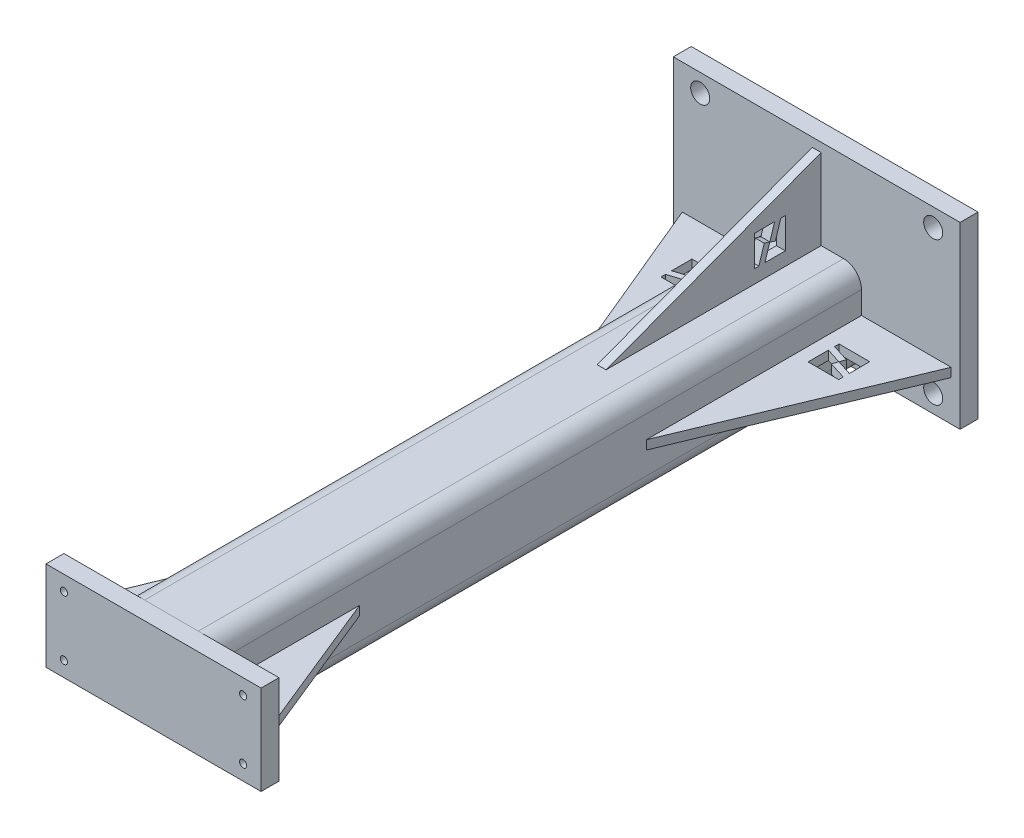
ISO-10303-21;
HEADER;
FILE_DESCRIPTION(('STEP AP214'),'2;1');
FILE_NAME('part.step','',(''),(''),'','','');
FILE_SCHEMA(('AUTOMOTIVE_DESIGN { 1 0 10303 214 1 1 1 1 }'));
ENDSEC;
DATA;
#1=APPLICATION_CONTEXT('core data for automotive mechanical design processes');
#2=APPLICATION_PROTOCOL_DEFINITION('international standard','automotive_design',2000,#1);
#3=PRODUCT_CONTEXT('',#1,'mechanical');
#4=PRODUCT('Part','Part','',(#3));
#5=PRODUCT_RELATED_PRODUCT_CATEGORY('part','',(#4));
#6=PRODUCT_DEFINITION_FORMATION('','',#4);
#7=PRODUCT_DEFINITION_CONTEXT('part definition',#1,'design');
#8=PRODUCT_DEFINITION('design','',#6,#7);
#9=PRODUCT_DEFINITION_SHAPE('','',#8);
#10=(LENGTH_UNIT() NAMED_UNIT(*) SI_UNIT(.MILLI.,.METRE.));
#11=(NAMED_UNIT(*) PLANE_ANGLE_UNIT() SI_UNIT($,.RADIAN.));
#12=(NAMED_UNIT(*) SI_UNIT($,.STERADIAN.) SOLID_ANGLE_UNIT());
#13=UNCERTAINTY_MEASURE_WITH_UNIT(LENGTH_MEASURE(1.E-05),#10,'distance_accuracy_value','');
#14=(GEOMETRIC_REPRESENTATION_CONTEXT(3) GLOBAL_UNCERTAINTY_ASSIGNED_CONTEXT((#13)) GLOBAL_UNIT_ASSIGNED_CONTEXT((#10,
#11,#12)) REPRESENTATION_CONTEXT('',''));
#15=CARTESIAN_POINT('',(0.,0.,0.));
#16=DIRECTION('',(0.,0.,1.));
#17=DIRECTION('',(1.,0.,0.));
#18=AXIS2_PLACEMENT_3D('',#15,#16,#17);
#19=CARTESIAN_POINT('',(-73.025,3.17500000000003,0.));
#20=DIRECTION('',(0.,0.,-1.));
#21=DIRECTION('',(1.,0.,0.));
#22=AXIS2_PLACEMENT_3D('',#19,#20,#21);
#23=PLANE('',#22);
#24=DIRECTION('',(-1.,0.,0.));
#25=VECTOR('',#24,1.);
#26=CARTESIAN_POINT('',(-73.025,-3.17499999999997,0.));
#27=LINE('',#26,#25);
#28=CARTESIAN_POINT('',(-31.75,-3.17499999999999,0.));
#29=VERTEX_POINT('',#28);
#30=CARTESIAN_POINT('',(-73.025,-3.17499999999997,0.));
#31=VERTEX_POINT('',#30);
#32=EDGE_CURVE('E145',#29,#31,#27,.T.);
#33=ORIENTED_EDGE('',*,*,#32,.F.);
#34=DIRECTION('',(0.,-1.,0.));
#35=VECTOR('',#34,1.);
#36=CARTESIAN_POINT('',(-31.75,3.17500000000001,0.));
#37=LINE('',#36,#35);
#38=CARTESIAN_POINT('',(-31.75,3.17500000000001,0.));
#39=VERTEX_POINT('',#38);
#40=EDGE_CURVE('E140',#39,#29,#37,.T.);
#41=ORIENTED_EDGE('',*,*,#40,.F.);
#42=DIRECTION('',(-1.,0.,0.));
#43=VECTOR('',#42,1.);
#44=CARTESIAN_POINT('',(-73.025,3.17500000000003,0.));
#45=LINE('',#44,#43);
#46=CARTESIAN_POINT('',(-73.025,3.17500000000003,0.));
#47=VERTEX_POINT('',#46);
#48=EDGE_CURVE('E132',#39,#47,#45,.T.);
#49=ORIENTED_EDGE('',*,*,#48,.T.);
#50=DIRECTION('',(0.,-1.,0.));
#51=VECTOR('',#50,1.);
#52=CARTESIAN_POINT('',(-73.025,3.17500000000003,0.));
#53=LINE('',#52,#51);
#54=EDGE_CURVE('E13',#47,#31,#53,.T.);
#55=ORIENTED_EDGE('',*,*,#54,.T.);
#56=EDGE_LOOP('',(#33,#41,#49,#55));
#57=FACE_BOUND('',#56,.T.);
#58=ADVANCED_FACE('F93',(#57),#23,.F.);
#59=CARTESIAN_POINT('',(-73.025,3.17500000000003,0.));
#60=DIRECTION('',(0.926466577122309,0.,0.376377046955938));
#61=DIRECTION('',(-0.376377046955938,0.,0.926466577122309));
#62=AXIS2_PLACEMENT_3D('',#59,#60,#61);
#63=PLANE('',#62);
#64=DIRECTION('',(0.376377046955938,0.,-0.926466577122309));
#65=VECTOR('',#64,1.);
#66=CARTESIAN_POINT('',(-73.025,-3.17499999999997,0.));
#67=LINE('',#66,#65);
#68=CARTESIAN_POINT('',(-31.75,-3.17499999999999,-101.6));
#69=VERTEX_POINT('',#68);
#70=EDGE_CURVE('E137',#31,#69,#67,.T.);
#71=ORIENTED_EDGE('',*,*,#70,.F.);
#72=ORIENTED_EDGE('',*,*,#54,.F.);
#73=DIRECTION('',(0.376377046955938,0.,-0.926466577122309));
#74=VECTOR('',#73,1.);
#75=CARTESIAN_POINT('',(-73.025,3.17500000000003,0.));
#76=LINE('',#75,#74);
#77=CARTESIAN_POINT('',(-31.75,3.17500000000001,-101.6));
#78=VERTEX_POINT('',#77);
#79=EDGE_CURVE('E128',#47,#78,#76,.T.);
#80=ORIENTED_EDGE('',*,*,#79,.T.);
#81=DIRECTION('',(0.,-1.,0.));
#82=VECTOR('',#81,1.);
#83=CARTESIAN_POINT('',(-31.75,3.17500000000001,-101.6));
#84=LINE('',#83,#82);
#85=EDGE_CURVE('E101',#78,#69,#84,.T.);
#86=ORIENTED_EDGE('',*,*,#85,.T.);
#87=EDGE_LOOP('',(#71,#72,#80,#86));
#88=FACE_BOUND('',#87,.T.);
#89=ADVANCED_FACE('F136',(#88),#63,.F.);
#90=CARTESIAN_POINT('',(-31.75,3.17500000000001,0.));
#91=DIRECTION('',(-1.,0.,0.));
#92=DIRECTION('',(0.,0.,-1.));
#93=AXIS2_PLACEMENT_3D('',#90,#91,#92);
#94=PLANE('',#93);
#95=DIRECTION('',(0.,0.,1.));
#96=VECTOR('',#95,1.);
#97=CARTESIAN_POINT('',(-31.75,-3.17499999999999,0.));
#98=LINE('',#97,#96);
#99=EDGE_CURVE('E120',#69,#29,#98,.T.);
#100=ORIENTED_EDGE('',*,*,#99,.F.);
#101=ORIENTED_EDGE('',*,*,#85,.F.);
#102=DIRECTION('',(0.,0.,1.));
#103=VECTOR('',#102,1.);
#104=CARTESIAN_POINT('',(-31.75,3.17500000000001,0.));
#105=LINE('',#104,#103);
#106=EDGE_CURVE('E109',#78,#39,#105,.T.);
#107=ORIENTED_EDGE('',*,*,#106,.T.);
#108=ORIENTED_EDGE('',*,*,#40,.T.);
#109=EDGE_LOOP('',(#100,#101,#107,#108));
#110=FACE_BOUND('',#109,.T.);
#111=ADVANCED_FACE('F154',(#110),#94,.F.);
#112=CARTESIAN_POINT('',(0.,3.175,0.));
#113=DIRECTION('',(0.,-1.,0.));
#114=DIRECTION('',(0.,0.,-1.));
#115=AXIS2_PLACEMENT_3D('',#112,#113,#114);
#116=PLANE('',#115);
#117=ORIENTED_EDGE('',*,*,#48,.F.);
#118=ORIENTED_EDGE('',*,*,#106,.F.);
#119=ORIENTED_EDGE('',*,*,#79,.F.);
#120=EDGE_LOOP('',(#117,#118,#119));
#121=FACE_BOUND('',#120,.T.);
#122=ADVANCED_FACE('F130',(#121),#116,.F.);
#123=CARTESIAN_POINT('',(0.,-3.175,0.));
#124=DIRECTION('',(0.,-1.,0.));
#125=DIRECTION('',(0.,0.,-1.));
#126=AXIS2_PLACEMENT_3D('',#123,#124,#125);
#127=PLANE('',#126);
#128=ORIENTED_EDGE('',*,*,#32,.T.);
#129=ORIENTED_EDGE('',*,*,#70,.T.);
#130=ORIENTED_EDGE('',*,*,#99,.T.);
#131=EDGE_LOOP('',(#128,#129,#130));
#132=FACE_BOUND('',#131,.T.);
#133=ADVANCED_FACE('F148',(#132),#127,.T.);
#134=CLOSED_SHELL('',(#58,#89,#111,#122,#133));
#135=MANIFOLD_SOLID_BREP('B2',#134);
#136=CARTESIAN_POINT('',(73.025,3.175,0.));
#137=DIRECTION('',(0.,0.,-1.));
#138=DIRECTION('',(-1.,0.,0.));
#139=AXIS2_PLACEMENT_3D('',#136,#137,#138);
#140=PLANE('',#139);
#141=DIRECTION('',(1.,0.,0.));
#142=VECTOR('',#141,1.);
#143=CARTESIAN_POINT('',(73.025,-3.175,0.));
#144=LINE('',#143,#142);
#145=CARTESIAN_POINT('',(31.75,-3.175,0.));
#146=VERTEX_POINT('',#145);
#147=CARTESIAN_POINT('',(73.025,-3.175,0.));
#148=VERTEX_POINT('',#147);
#149=EDGE_CURVE('E247',#146,#148,#144,.T.);
#150=ORIENTED_EDGE('',*,*,#149,.T.);
#151=DIRECTION('',(0.,-1.,0.));
#152=VECTOR('',#151,1.);
#153=CARTESIAN_POINT('',(73.025,3.175,0.));
#154=LINE('',#153,#152);
#155=CARTESIAN_POINT('',(73.025,3.175,0.));
#156=VERTEX_POINT('',#155);
#157=EDGE_CURVE('E91',#156,#148,#154,.T.);
#158=ORIENTED_EDGE('',*,*,#157,.F.);
#159=DIRECTION('',(1.,0.,0.));
#160=VECTOR('',#159,1.);
#161=CARTESIAN_POINT('',(73.025,3.175,0.));
#162=LINE('',#161,#160);
#163=CARTESIAN_POINT('',(31.75,3.175,0.));
#164=VERTEX_POINT('',#163);
#165=EDGE_CURVE('E240',#164,#156,#162,.T.);
#166=ORIENTED_EDGE('',*,*,#165,.F.);
#167=DIRECTION('',(0.,-1.,0.));
#168=VECTOR('',#167,1.);
#169=CARTESIAN_POINT('',(31.75,3.175,0.));
#170=LINE('',#169,#168);
#171=EDGE_CURVE('E248',#164,#146,#170,.T.);
#172=ORIENTED_EDGE('',*,*,#171,.T.);
#173=EDGE_LOOP('',(#150,#158,#166,#172));
#174=FACE_BOUND('',#173,.T.);
#175=ADVANCED_FACE('F200',(#174),#140,.F.);
#176=CARTESIAN_POINT('',(73.025,3.175,0.));
#177=DIRECTION('',(-0.926466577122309,0.,0.376377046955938));
#178=DIRECTION('',(0.376377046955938,0.,0.926466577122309));
#179=AXIS2_PLACEMENT_3D('',#176,#177,#178);
#180=PLANE('',#179);
#181=DIRECTION('',(-0.376377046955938,0.,-0.926466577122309));
#182=VECTOR('',#181,1.);
#183=CARTESIAN_POINT('',(73.025,-3.175,0.));
#184=LINE('',#183,#182);
#185=CARTESIAN_POINT('',(31.75,-3.175,-101.6));
#186=VERTEX_POINT('',#185);
#187=EDGE_CURVE('E228',#148,#186,#184,.T.);
#188=ORIENTED_EDGE('',*,*,#187,.T.);
#189=DIRECTION('',(0.,-1.,0.));
#190=VECTOR('',#189,1.);
#191=CARTESIAN_POINT('',(31.75,3.175,-101.6));
#192=LINE('',#191,#190);
#193=CARTESIAN_POINT('',(31.75,3.175,-101.6));
#194=VERTEX_POINT('',#193);
#195=EDGE_CURVE('E208',#194,#186,#192,.T.);
#196=ORIENTED_EDGE('',*,*,#195,.F.);
#197=DIRECTION('',(-0.376377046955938,0.,-0.926466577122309));
#198=VECTOR('',#197,1.);
#199=CARTESIAN_POINT('',(73.025,3.175,0.));
#200=LINE('',#199,#198);
#201=EDGE_CURVE('E236',#156,#194,#200,.T.);
#202=ORIENTED_EDGE('',*,*,#201,.F.);
#203=ORIENTED_EDGE('',*,*,#157,.T.);
#204=EDGE_LOOP('',(#188,#196,#202,#203));
#205=FACE_BOUND('',#204,.T.);
#206=ADVANCED_FACE('F237',(#205),#180,.F.);
#207=CARTESIAN_POINT('',(31.75,3.175,0.));
#208=DIRECTION('',(1.,0.,0.));
#209=DIRECTION('',(0.,0.,-1.));
#210=AXIS2_PLACEMENT_3D('',#207,#208,#209);
#211=PLANE('',#210);
#212=DIRECTION('',(0.,0.,1.));
#213=VECTOR('',#212,1.);
#214=CARTESIAN_POINT('',(31.75,-3.175,0.));
#215=LINE('',#214,#213);
#216=EDGE_CURVE('E233',#186,#146,#215,.T.);
#217=ORIENTED_EDGE('',*,*,#216,.T.);
#218=ORIENTED_EDGE('',*,*,#171,.F.);
#219=DIRECTION('',(0.,0.,1.));
#220=VECTOR('',#219,1.);
#221=CARTESIAN_POINT('',(31.75,3.175,0.));
#222=LINE('',#221,#220);
#223=EDGE_CURVE('E216',#194,#164,#222,.T.);
#224=ORIENTED_EDGE('',*,*,#223,.F.);
#225=ORIENTED_EDGE('',*,*,#195,.T.);
#226=EDGE_LOOP('',(#217,#218,#224,#225));
#227=FACE_BOUND('',#226,.T.);
#228=ADVANCED_FACE('F255',(#227),#211,.F.);
#229=CARTESIAN_POINT('',(0.,3.175,0.));
#230=DIRECTION('',(0.,-1.,0.));
#231=DIRECTION('',(0.,0.,-1.));
#232=AXIS2_PLACEMENT_3D('',#229,#230,#231);
#233=PLANE('',#232);
#234=ORIENTED_EDGE('',*,*,#165,.T.);
#235=ORIENTED_EDGE('',*,*,#201,.T.);
#236=ORIENTED_EDGE('',*,*,#223,.T.);
#237=EDGE_LOOP('',(#234,#235,#236));
#238=FACE_BOUND('',#237,.T.);
#239=ADVANCED_FACE('F243',(#238),#233,.F.);
#240=CARTESIAN_POINT('',(0.,-3.175,0.));
#241=DIRECTION('',(0.,-1.,0.));
#242=DIRECTION('',(0.,0.,-1.));
#243=AXIS2_PLACEMENT_3D('',#240,#241,#242);
#244=PLANE('',#243);
#245=ORIENTED_EDGE('',*,*,#149,.F.);
#246=ORIENTED_EDGE('',*,*,#216,.F.);
#247=ORIENTED_EDGE('',*,*,#187,.F.);
#248=EDGE_LOOP('',(#245,#246,#247));
#249=FACE_BOUND('',#248,.T.);
#250=ADVANCED_FACE('F256',(#249),#244,.T.);
#251=CLOSED_SHELL('',(#175,#206,#228,#239,#250));
#252=MANIFOLD_SOLID_BREP('B7',#251);
#253=CARTESIAN_POINT('',(0.,0.,0.));
#254=DIRECTION('',(0.,0.,1.));
#255=DIRECTION('',(1.,0.,0.));
#256=AXIS2_PLACEMENT_3D('',#253,#254,#255);
#257=PLANE('',#256);
#258=CARTESIAN_POINT('',(63.5,21.0311999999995,0.));
#259=DIRECTION('',(0.,0.,-1.));
#260=DIRECTION('',(-1.,0.,0.));
#261=AXIS2_PLACEMENT_3D('',#258,#259,#260);
#262=CIRCLE('',#261,2.55270000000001);
#263=CARTESIAN_POINT('',(60.9473,21.0311999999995,0.));
#264=VERTEX_POINT('',#263);
#265=EDGE_CURVE('E405',#264,#264,#262,.T.);
#266=ORIENTED_EDGE('',*,*,#265,.F.);
#267=EDGE_LOOP('',(#266));
#268=FACE_BOUND('',#267,.T.);
#269=CARTESIAN_POINT('',(-63.4999999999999,21.0311999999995,0.));
#270=DIRECTION('',(0.,0.,-1.));
#271=DIRECTION('',(-1.,0.,0.));
#272=AXIS2_PLACEMENT_3D('',#269,#270,#271);
#273=CIRCLE('',#272,2.5527);
#274=CARTESIAN_POINT('',(-66.0526999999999,21.0311999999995,0.));
#275=VERTEX_POINT('',#274);
#276=EDGE_CURVE('E393',#275,#275,#273,.T.);
#277=ORIENTED_EDGE('',*,*,#276,.F.);
#278=EDGE_LOOP('',(#277));
#279=FACE_BOUND('',#278,.T.);
#280=CARTESIAN_POINT('',(-63.5,-21.0312000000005,0.));
#281=DIRECTION('',(0.,0.,-1.));
#282=DIRECTION('',(-1.,0.,0.));
#283=AXIS2_PLACEMENT_3D('',#280,#281,#282);
#284=CIRCLE('',#283,2.5527);
#285=CARTESIAN_POINT('',(-66.0527,-21.0312000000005,0.));
#286=VERTEX_POINT('',#285);
#287=EDGE_CURVE('E387',#286,#286,#284,.T.);
#288=ORIENTED_EDGE('',*,*,#287,.F.);
#289=EDGE_LOOP('',(#288));
#290=FACE_BOUND('',#289,.T.);
#291=DIRECTION('',(-1.,0.,0.));
#292=VECTOR('',#291,1.);
#293=CARTESIAN_POINT('',(76.2,31.75,0.));
#294=LINE('',#293,#292);
#295=CARTESIAN_POINT('',(76.2,31.75,0.));
#296=VERTEX_POINT('',#295);
#297=CARTESIAN_POINT('',(-76.2,31.75,0.));
#298=VERTEX_POINT('',#297);
#299=EDGE_CURVE('E371',#296,#298,#294,.T.);
#300=ORIENTED_EDGE('',*,*,#299,.F.);
#301=DIRECTION('',(0.,1.,0.));
#302=VECTOR('',#301,1.);
#303=CARTESIAN_POINT('',(76.2,-31.75,0.));
#304=LINE('',#303,#302);
#305=CARTESIAN_POINT('',(76.2,-31.75,0.));
#306=VERTEX_POINT('',#305);
#307=EDGE_CURVE('E347',#306,#296,#304,.T.);
#308=ORIENTED_EDGE('',*,*,#307,.F.);
#309=DIRECTION('',(1.,0.,0.));
#310=VECTOR('',#309,1.);
#311=CARTESIAN_POINT('',(-76.2,-31.75,0.));
#312=LINE('',#311,#310);
#313=CARTESIAN_POINT('',(-76.2,-31.75,0.));
#314=VERTEX_POINT('',#313);
#315=EDGE_CURVE('E341',#314,#306,#312,.T.);
#316=ORIENTED_EDGE('',*,*,#315,.F.);
#317=DIRECTION('',(0.,-1.,0.));
#318=VECTOR('',#317,1.);
#319=CARTESIAN_POINT('',(-76.2,31.75,0.));
#320=LINE('',#319,#318);
#321=EDGE_CURVE('E363',#298,#314,#320,.T.);
#322=ORIENTED_EDGE('',*,*,#321,.F.);
#323=EDGE_LOOP('',(#300,#308,#316,#322));
#324=FACE_BOUND('',#323,.T.);
#325=CARTESIAN_POINT('',(63.4999999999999,-21.0312000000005,0.));
#326=DIRECTION('',(0.,0.,-1.));
#327=DIRECTION('',(-1.,0.,0.));
#328=AXIS2_PLACEMENT_3D('',#325,#326,#327);
#329=CIRCLE('',#328,2.55270000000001);
#330=CARTESIAN_POINT('',(60.9472999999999,-21.0312000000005,0.));
#331=VERTEX_POINT('',#330);
#332=EDGE_CURVE('E399',#331,#331,#329,.T.);
#333=ORIENTED_EDGE('',*,*,#332,.F.);
#334=EDGE_LOOP('',(#333));
#335=FACE_BOUND('',#334,.T.);
#336=ADVANCED_FACE('F307',(#268,#279,#290,#324,#335),#257,.F.);
#337=CARTESIAN_POINT('',(76.2,31.75,12.7));
#338=DIRECTION('',(0.,-1.,0.));
#339=DIRECTION('',(1.,0.,0.));
#340=AXIS2_PLACEMENT_3D('',#337,#338,#339);
#341=PLANE('',#340);
#342=ORIENTED_EDGE('',*,*,#299,.T.);
#343=DIRECTION('',(0.,0.,-1.));
#344=VECTOR('',#343,1.);
#345=CARTESIAN_POINT('',(-76.2,31.75,12.7));
#346=LINE('',#345,#344);
#347=CARTESIAN_POINT('',(-76.2,31.75,12.7));
#348=VERTEX_POINT('',#347);
#349=EDGE_CURVE('E198',#348,#298,#346,.T.);
#350=ORIENTED_EDGE('',*,*,#349,.F.);
#351=DIRECTION('',(-1.,0.,0.));
#352=VECTOR('',#351,1.);
#353=CARTESIAN_POINT('',(76.2,31.75,12.7));
#354=LINE('',#353,#352);
#355=CARTESIAN_POINT('',(76.2,31.75,12.7));
#356=VERTEX_POINT('',#355);
#357=EDGE_CURVE('E359',#356,#348,#354,.T.);
#358=ORIENTED_EDGE('',*,*,#357,.F.);
#359=DIRECTION('',(0.,0.,-1.));
#360=VECTOR('',#359,1.);
#361=CARTESIAN_POINT('',(76.2,31.75,12.7));
#362=LINE('',#361,#360);
#363=EDGE_CURVE('E367',#356,#296,#362,.T.);
#364=ORIENTED_EDGE('',*,*,#363,.T.);
#365=EDGE_LOOP('',(#342,#350,#358,#364));
#366=FACE_BOUND('',#365,.T.);
#367=ADVANCED_FACE('F309',(#366),#341,.F.);
#368=CARTESIAN_POINT('',(-76.2,31.75,12.7));
#369=DIRECTION('',(1.,0.,0.));
#370=DIRECTION('',(0.,1.,0.));
#371=AXIS2_PLACEMENT_3D('',#368,#369,#370);
#372=PLANE('',#371);
#373=ORIENTED_EDGE('',*,*,#321,.T.);
#374=DIRECTION('',(0.,0.,-1.));
#375=VECTOR('',#374,1.);
#376=CARTESIAN_POINT('',(-76.2,-31.75,12.7));
#377=LINE('',#376,#375);
#378=CARTESIAN_POINT('',(-76.2,-31.75,12.7));
#379=VERTEX_POINT('',#378);
#380=EDGE_CURVE('E316',#379,#314,#377,.T.);
#381=ORIENTED_EDGE('',*,*,#380,.F.);
#382=DIRECTION('',(0.,-1.,0.));
#383=VECTOR('',#382,1.);
#384=CARTESIAN_POINT('',(-76.2,31.75,12.7));
#385=LINE('',#384,#383);
#386=EDGE_CURVE('E354',#348,#379,#385,.T.);
#387=ORIENTED_EDGE('',*,*,#386,.F.);
#388=ORIENTED_EDGE('',*,*,#349,.T.);
#389=EDGE_LOOP('',(#373,#381,#387,#388));
#390=FACE_BOUND('',#389,.T.);
#391=ADVANCED_FACE('F362',(#390),#372,.F.);
#392=CARTESIAN_POINT('',(-76.2,-31.75,12.7));
#393=DIRECTION('',(0.,1.,0.));
#394=DIRECTION('',(-1.,0.,0.));
#395=AXIS2_PLACEMENT_3D('',#392,#393,#394);
#396=PLANE('',#395);
#397=ORIENTED_EDGE('',*,*,#315,.T.);
#398=DIRECTION('',(0.,0.,-1.));
#399=VECTOR('',#398,1.);
#400=CARTESIAN_POINT('',(76.2,-31.75,12.7));
#401=LINE('',#400,#399);
#402=CARTESIAN_POINT('',(76.2,-31.75,12.7));
#403=VERTEX_POINT('',#402);
#404=EDGE_CURVE('E364',#403,#306,#401,.T.);
#405=ORIENTED_EDGE('',*,*,#404,.F.);
#406=DIRECTION('',(1.,0.,0.));
#407=VECTOR('',#406,1.);
#408=CARTESIAN_POINT('',(-76.2,-31.75,12.7));
#409=LINE('',#408,#407);
#410=EDGE_CURVE('E357',#379,#403,#409,.T.);
#411=ORIENTED_EDGE('',*,*,#410,.F.);
#412=ORIENTED_EDGE('',*,*,#380,.T.);
#413=EDGE_LOOP('',(#397,#405,#411,#412));
#414=FACE_BOUND('',#413,.T.);
#415=ADVANCED_FACE('F365',(#414),#396,.F.);
#416=CARTESIAN_POINT('',(76.2,-31.75,12.7));
#417=DIRECTION('',(-1.,0.,0.));
#418=DIRECTION('',(0.,-1.,0.));
#419=AXIS2_PLACEMENT_3D('',#416,#417,#418);
#420=PLANE('',#419);
#421=ORIENTED_EDGE('',*,*,#307,.T.);
#422=ORIENTED_EDGE('',*,*,#363,.F.);
#423=DIRECTION('',(0.,1.,0.));
#424=VECTOR('',#423,1.);
#425=CARTESIAN_POINT('',(76.2,-31.75,12.7));
#426=LINE('',#425,#424);
#427=EDGE_CURVE('E324',#403,#356,#426,.T.);
#428=ORIENTED_EDGE('',*,*,#427,.F.);
#429=ORIENTED_EDGE('',*,*,#404,.T.);
#430=EDGE_LOOP('',(#421,#422,#428,#429));
#431=FACE_BOUND('',#430,.T.);
#432=ADVANCED_FACE('F379',(#431),#420,.F.);
#433=CARTESIAN_POINT('',(0.,0.,12.7));
#434=DIRECTION('',(0.,0.,1.));
#435=DIRECTION('',(1.,0.,0.));
#436=AXIS2_PLACEMENT_3D('',#433,#434,#435);
#437=PLANE('',#436);
#438=CARTESIAN_POINT('',(63.5,21.0311999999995,12.7));
#439=DIRECTION('',(0.,0.,-1.));
#440=DIRECTION('',(-1.,0.,0.));
#441=AXIS2_PLACEMENT_3D('',#438,#439,#440);
#442=CIRCLE('',#441,2.55269999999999);
#443=CARTESIAN_POINT('',(60.9473,21.0311999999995,12.7));
#444=VERTEX_POINT('',#443);
#445=EDGE_CURVE('E402',#444,#444,#442,.T.);
#446=ORIENTED_EDGE('',*,*,#445,.T.);
#447=EDGE_LOOP('',(#446));
#448=FACE_BOUND('',#447,.T.);
#449=CARTESIAN_POINT('',(63.4999999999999,-21.0312000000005,12.7));
#450=DIRECTION('',(0.,0.,-1.));
#451=DIRECTION('',(-1.,0.,0.));
#452=AXIS2_PLACEMENT_3D('',#449,#450,#451);
#453=CIRCLE('',#452,2.55269999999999);
#454=CARTESIAN_POINT('',(60.9473,-21.0312000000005,12.7));
#455=VERTEX_POINT('',#454);
#456=EDGE_CURVE('E396',#455,#455,#453,.T.);
#457=ORIENTED_EDGE('',*,*,#456,.T.);
#458=EDGE_LOOP('',(#457));
#459=FACE_BOUND('',#458,.T.);
#460=CARTESIAN_POINT('',(-63.4999999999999,21.0311999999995,12.7));
#461=DIRECTION('',(0.,0.,-1.));
#462=DIRECTION('',(-1.,0.,0.));
#463=AXIS2_PLACEMENT_3D('',#460,#461,#462);
#464=CIRCLE('',#463,2.5527);
#465=CARTESIAN_POINT('',(-66.0526999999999,21.0311999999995,12.7));
#466=VERTEX_POINT('',#465);
#467=EDGE_CURVE('E390',#466,#466,#464,.T.);
#468=ORIENTED_EDGE('',*,*,#467,.T.);
#469=EDGE_LOOP('',(#468));
#470=FACE_BOUND('',#469,.T.);
#471=CARTESIAN_POINT('',(-63.5,-21.0312000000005,12.7));
#472=DIRECTION('',(0.,0.,-1.));
#473=DIRECTION('',(-1.,0.,0.));
#474=AXIS2_PLACEMENT_3D('',#471,#472,#473);
#475=CIRCLE('',#474,2.5527);
#476=CARTESIAN_POINT('',(-66.0527,-21.0312000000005,12.7));
#477=VERTEX_POINT('',#476);
#478=EDGE_CURVE('E374',#477,#477,#475,.T.);
#479=ORIENTED_EDGE('',*,*,#478,.T.);
#480=EDGE_LOOP('',(#479));
#481=FACE_BOUND('',#480,.T.);
#482=ORIENTED_EDGE('',*,*,#357,.T.);
#483=ORIENTED_EDGE('',*,*,#386,.T.);
#484=ORIENTED_EDGE('',*,*,#410,.T.);
#485=ORIENTED_EDGE('',*,*,#427,.T.);
#486=EDGE_LOOP('',(#482,#483,#484,#485));
#487=FACE_BOUND('',#486,.T.);
#488=ADVANCED_FACE('F355',(#448,#459,#470,#481,#487),#437,.T.);
#489=CARTESIAN_POINT('',(-63.5,-21.0312000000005,0.));
#490=DIRECTION('',(0.,0.,-1.));
#491=DIRECTION('',(-1.,0.,0.));
#492=AXIS2_PLACEMENT_3D('',#489,#490,#491);
#493=CYLINDRICAL_SURFACE('',#492,2.5527);
#494=ORIENTED_EDGE('',*,*,#478,.F.);
#495=EDGE_LOOP('',(#494));
#496=FACE_BOUND('',#495,.T.);
#497=ORIENTED_EDGE('',*,*,#287,.T.);
#498=EDGE_LOOP('',(#497));
#499=FACE_BOUND('',#498,.T.);
#500=ADVANCED_FACE('F418',(#496,#499),#493,.F.);
#501=CARTESIAN_POINT('',(-63.4999999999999,21.0311999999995,0.));
#502=DIRECTION('',(0.,0.,-1.));
#503=DIRECTION('',(-1.,0.,0.));
#504=AXIS2_PLACEMENT_3D('',#501,#502,#503);
#505=CYLINDRICAL_SURFACE('',#504,2.5527);
#506=ORIENTED_EDGE('',*,*,#467,.F.);
#507=EDGE_LOOP('',(#506));
#508=FACE_BOUND('',#507,.T.);
#509=ORIENTED_EDGE('',*,*,#276,.T.);
#510=EDGE_LOOP('',(#509));
#511=FACE_BOUND('',#510,.T.);
#512=ADVANCED_FACE('F420',(#508,#511),#505,.F.);
#513=CARTESIAN_POINT('',(63.4999999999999,-21.0312000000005,0.));
#514=DIRECTION('',(0.,0.,-1.));
#515=DIRECTION('',(-1.,0.,0.));
#516=AXIS2_PLACEMENT_3D('',#513,#514,#515);
#517=CYLINDRICAL_SURFACE('',#516,2.5527);
#518=ORIENTED_EDGE('',*,*,#456,.F.);
#519=EDGE_LOOP('',(#518));
#520=FACE_BOUND('',#519,.T.);
#521=ORIENTED_EDGE('',*,*,#332,.T.);
#522=EDGE_LOOP('',(#521));
#523=FACE_BOUND('',#522,.T.);
#524=ADVANCED_FACE('F427',(#520,#523),#517,.F.);
#525=CARTESIAN_POINT('',(63.5,21.0311999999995,0.));
#526=DIRECTION('',(0.,0.,-1.));
#527=DIRECTION('',(-1.,0.,0.));
#528=AXIS2_PLACEMENT_3D('',#525,#526,#527);
#529=CYLINDRICAL_SURFACE('',#528,2.5527);
#530=ORIENTED_EDGE('',*,*,#445,.F.);
#531=EDGE_LOOP('',(#530));
#532=FACE_BOUND('',#531,.T.);
#533=ORIENTED_EDGE('',*,*,#265,.T.);
#534=EDGE_LOOP('',(#533));
#535=FACE_BOUND('',#534,.T.);
#536=ADVANCED_FACE('F409',(#532,#535),#529,.F.);
#537=CLOSED_SHELL('',(#336,#367,#391,#415,#432,#488,#500,#512,#524,#536));
#538=MANIFOLD_SOLID_BREP('B85',#537);
#539=CARTESIAN_POINT('',(31.75,-3.175,-304.8));
#540=DIRECTION('',(-0.923076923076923,0.,-0.384615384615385));
#541=DIRECTION('',(0.384615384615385,0.,-0.923076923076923));
#542=AXIS2_PLACEMENT_3D('',#539,#540,#541);
#543=PLANE('',#542);
#544=DIRECTION('',(0.384615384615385,0.,-0.923076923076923));
#545=VECTOR('',#544,1.);
#546=CARTESIAN_POINT('',(31.75,3.175,-304.8));
#547=LINE('',#546,#545);
#548=CARTESIAN_POINT('',(31.75,3.175,-304.8));
#549=VERTEX_POINT('',#548);
#550=CARTESIAN_POINT('',(95.25,3.175,-457.2));
#551=VERTEX_POINT('',#550);
#552=EDGE_CURVE('E731',#549,#551,#547,.T.);
#553=ORIENTED_EDGE('',*,*,#552,.F.);
#554=DIRECTION('',(0.,1.,0.));
#555=VECTOR('',#554,1.);
#556=CARTESIAN_POINT('',(31.75,-3.175,-304.8));
#557=LINE('',#556,#555);
#558=CARTESIAN_POINT('',(31.75,-3.175,-304.8));
#559=VERTEX_POINT('',#558);
#560=EDGE_CURVE('E741',#559,#549,#557,.T.);
#561=ORIENTED_EDGE('',*,*,#560,.F.);
#562=DIRECTION('',(0.384615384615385,0.,-0.923076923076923));
#563=VECTOR('',#562,1.);
#564=CARTESIAN_POINT('',(31.75,-3.175,-304.8));
#565=LINE('',#564,#563);
#566=CARTESIAN_POINT('',(95.25,-3.175,-457.2));
#567=VERTEX_POINT('',#566);
#568=EDGE_CURVE('E732',#559,#567,#565,.T.);
#569=ORIENTED_EDGE('',*,*,#568,.T.);
#570=DIRECTION('',(0.,1.,0.));
#571=VECTOR('',#570,1.);
#572=CARTESIAN_POINT('',(95.25,-3.175,-457.2));
#573=LINE('',#572,#571);
#574=EDGE_CURVE('E305',#567,#551,#573,.T.);
#575=ORIENTED_EDGE('',*,*,#574,.T.);
#576=EDGE_LOOP('',(#553,#561,#569,#575));
#577=FACE_BOUND('',#576,.T.);
#578=ADVANCED_FACE('F524',(#577),#543,.F.);
#579=CARTESIAN_POINT('',(31.75,-3.175,-457.2));
#580=DIRECTION('',(0.,0.,1.));
#581=DIRECTION('',(-1.,0.,0.));
#582=AXIS2_PLACEMENT_3D('',#579,#580,#581);
#583=PLANE('',#582);
#584=DIRECTION('',(-1.,0.,0.));
#585=VECTOR('',#584,1.);
#586=CARTESIAN_POINT('',(31.75,3.175,-457.2));
#587=LINE('',#586,#585);
#588=CARTESIAN_POINT('',(31.75,3.175,-457.2));
#589=VERTEX_POINT('',#588);
#590=EDGE_CURVE('E744',#551,#589,#587,.T.);
#591=ORIENTED_EDGE('',*,*,#590,.F.);
#592=ORIENTED_EDGE('',*,*,#574,.F.);
#593=DIRECTION('',(-1.,0.,0.));
#594=VECTOR('',#593,1.);
#595=CARTESIAN_POINT('',(31.75,-3.175,-457.2));
#596=LINE('',#595,#594);
#597=CARTESIAN_POINT('',(31.75,-3.175,-457.2));
#598=VERTEX_POINT('',#597);
#599=EDGE_CURVE('E735',#567,#598,#596,.T.);
#600=ORIENTED_EDGE('',*,*,#599,.T.);
#601=DIRECTION('',(0.,1.,0.));
#602=VECTOR('',#601,1.);
#603=CARTESIAN_POINT('',(31.75,-3.175,-457.2));
#604=LINE('',#603,#602);
#605=EDGE_CURVE('E531',#598,#589,#604,.T.);
#606=ORIENTED_EDGE('',*,*,#605,.T.);
#607=EDGE_LOOP('',(#591,#592,#600,#606));
#608=FACE_BOUND('',#607,.T.);
#609=ADVANCED_FACE('F752',(#608),#583,.F.);
#610=CARTESIAN_POINT('',(31.75,-3.175,-457.2));
#611=DIRECTION('',(1.,0.,0.));
#612=DIRECTION('',(0.,-1.,0.));
#613=AXIS2_PLACEMENT_3D('',#610,#611,#612);
#614=PLANE('',#613);
#615=DIRECTION('',(0.,0.,1.));
#616=VECTOR('',#615,1.);
#617=CARTESIAN_POINT('',(31.75,3.175,-457.2));
#618=LINE('',#617,#616);
#619=EDGE_CURVE('E736',#589,#549,#618,.T.);
#620=ORIENTED_EDGE('',*,*,#619,.F.);
#621=ORIENTED_EDGE('',*,*,#605,.F.);
#622=DIRECTION('',(0.,0.,1.));
#623=VECTOR('',#622,1.);
#624=CARTESIAN_POINT('',(31.75,-3.175,-457.2));
#625=LINE('',#624,#623);
#626=EDGE_CURVE('E739',#598,#559,#625,.T.);
#627=ORIENTED_EDGE('',*,*,#626,.T.);
#628=ORIENTED_EDGE('',*,*,#560,.T.);
#629=EDGE_LOOP('',(#620,#621,#627,#628));
#630=FACE_BOUND('',#629,.T.);
#631=ADVANCED_FACE('F762',(#630),#614,.F.);
#632=CARTESIAN_POINT('',(0.,-3.175,0.));
#633=DIRECTION('',(0.,1.,0.));
#634=DIRECTION('',(1.,0.,0.));
#635=AXIS2_PLACEMENT_3D('',#632,#633,#634);
#636=PLANE('',#635);
#637=DIRECTION('',(0.00262452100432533,0.,0.999996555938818));
#638=VECTOR('',#637,1.);
#639=CARTESIAN_POINT('',(64.1022202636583,-3.175,-0.16823820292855));
#640=LINE('',#639,#638);
#641=CARTESIAN_POINT('',(62.9693897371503,-3.17500000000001,-431.8));
#642=VERTEX_POINT('',#641);
#643=CARTESIAN_POINT('',(63.0072997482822,-3.17500000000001,-417.355504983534));
#644=VERTEX_POINT('',#643);
#645=EDGE_CURVE('E725',#642,#644,#640,.T.);
#646=ORIENTED_EDGE('',*,*,#645,.F.);
#647=DIRECTION('',(1.,0.,0.));
#648=VECTOR('',#647,1.);
#649=CARTESIAN_POINT('',(0.,-3.175,-431.8));
#650=LINE('',#649,#648);
#651=CARTESIAN_POINT('',(41.2749999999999,-3.17500000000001,-431.8));
#652=VERTEX_POINT('',#651);
#653=EDGE_CURVE('E722',#652,#642,#650,.T.);
#654=ORIENTED_EDGE('',*,*,#653,.F.);
#655=DIRECTION('',(0.,0.,-1.));
#656=VECTOR('',#655,1.);
#657=CARTESIAN_POINT('',(41.2749999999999,-3.175,0.));
#658=LINE('',#657,#656);
#659=CARTESIAN_POINT('',(41.2749999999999,-3.175,-428.58745635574));
#660=VERTEX_POINT('',#659);
#661=EDGE_CURVE('E719',#660,#652,#658,.T.);
#662=ORIENTED_EDGE('',*,*,#661,.F.);
#663=DIRECTION('',(-0.953723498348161,0.,-0.30068503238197));
#664=VECTOR('',#663,1.);
#665=CARTESIAN_POINT('',(126.637922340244,-3.175,-401.67467386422));
#666=LINE('',#665,#664);
#667=CARTESIAN_POINT('',(53.4409384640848,-3.17500000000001,-424.751841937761));
#668=VERTEX_POINT('',#667);
#669=EDGE_CURVE('E717',#668,#660,#666,.T.);
#670=ORIENTED_EDGE('',*,*,#669,.F.);
#671=DIRECTION('',(0.289099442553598,0.,-0.957299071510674));
#672=VECTOR('',#671,1.);
#673=CARTESIAN_POINT('',(-68.5776123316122,-3.175,-20.7100895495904));
#674=LINE('',#673,#672);
#675=CARTESIAN_POINT('',(52.2366256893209,-3.17500000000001,-420.763984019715));
#676=VERTEX_POINT('',#675);
#677=EDGE_CURVE('E636',#676,#668,#674,.T.);
#678=ORIENTED_EDGE('',*,*,#677,.F.);
#679=DIRECTION('',(-0.953399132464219,0.,-0.30171193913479));
#680=VECTOR('',#679,1.);
#681=CARTESIAN_POINT('',(125.78866484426,-3.175,-397.487763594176));
#682=LINE('',#681,#680);
#683=EDGE_CURVE('E728',#644,#676,#682,.T.);
#684=ORIENTED_EDGE('',*,*,#683,.F.);
#685=EDGE_LOOP('',(#646,#654,#662,#670,#678,#684));
#686=FACE_BOUND('',#685,.T.);
#687=DIRECTION('',(0.,0.,-1.));
#688=VECTOR('',#687,1.);
#689=CARTESIAN_POINT('',(41.2749999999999,-3.175,0.));
#690=LINE('',#689,#688);
#691=CARTESIAN_POINT('',(41.2749999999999,-3.175,-409.814048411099));
#692=VERTEX_POINT('',#691);
#693=CARTESIAN_POINT('',(41.2749999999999,-3.17500000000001,-424.25073577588));
#694=VERTEX_POINT('',#693);
#695=EDGE_CURVE('E710',#692,#694,#690,.T.);
#696=ORIENTED_EDGE('',*,*,#695,.F.);
#697=DIRECTION('',(-1.,0.,0.));
#698=VECTOR('',#697,1.);
#699=CARTESIAN_POINT('',(0.,-3.175,-409.814048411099));
#700=LINE('',#699,#698);
#701=CARTESIAN_POINT('',(62.9752547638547,-3.17500000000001,-409.814048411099));
#702=VERTEX_POINT('',#701);
#703=EDGE_CURVE('E707',#702,#692,#700,.T.);
#704=ORIENTED_EDGE('',*,*,#703,.F.);
#705=DIRECTION('',(0.,0.,1.));
#706=VECTOR('',#705,1.);
#707=CARTESIAN_POINT('',(62.9752547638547,-3.175,0.));
#708=LINE('',#707,#706);
#709=CARTESIAN_POINT('',(62.9752547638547,-3.17500000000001,-413.010976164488));
#710=VERTEX_POINT('',#709);
#711=EDGE_CURVE('E704',#710,#702,#708,.T.);
#712=ORIENTED_EDGE('',*,*,#711,.F.);
#713=DIRECTION('',(0.953687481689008,0.,0.300799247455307));
#714=VECTOR('',#713,1.);
#715=CARTESIAN_POINT('',(124.177842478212,-3.175,-393.707281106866));
#716=LINE('',#715,#714);
#717=CARTESIAN_POINT('',(50.8143950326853,-3.175,-416.846590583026));
#718=VERTEX_POINT('',#717);
#719=EDGE_CURVE('E702',#718,#710,#716,.T.);
#720=ORIENTED_EDGE('',*,*,#719,.F.);
#721=DIRECTION('',(-0.290216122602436,0.,0.956961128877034));
#722=VECTOR('',#721,1.);
#723=CARTESIAN_POINT('',(-69.2344155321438,-3.175,-20.9966141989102));
#724=LINE('',#723,#722);
#725=CARTESIAN_POINT('',(52.0237865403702,-3.17500000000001,-420.834448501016));
#726=VERTEX_POINT('',#725);
#727=EDGE_CURVE('E692',#726,#718,#724,.T.);
#728=ORIENTED_EDGE('',*,*,#727,.F.);
#729=DIRECTION('',(0.953022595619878,0.,0.302899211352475));
#730=VECTOR('',#729,1.);
#731=CARTESIAN_POINT('',(126.25526781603,-3.175,-397.241453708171));
#732=LINE('',#731,#730);
#733=EDGE_CURVE('E713',#694,#726,#732,.T.);
#734=ORIENTED_EDGE('',*,*,#733,.F.);
#735=EDGE_LOOP('',(#696,#704,#712,#720,#728,#734));
#736=FACE_BOUND('',#735,.T.);
#737=ORIENTED_EDGE('',*,*,#568,.F.);
#738=ORIENTED_EDGE('',*,*,#626,.F.);
#739=ORIENTED_EDGE('',*,*,#599,.F.);
#740=EDGE_LOOP('',(#737,#738,#739));
#741=FACE_BOUND('',#740,.T.);
#742=ADVANCED_FACE('F761',(#686,#736,#741),#636,.F.);
#743=CARTESIAN_POINT('',(0.,3.175,0.));
#744=DIRECTION('',(0.,1.,0.));
#745=DIRECTION('',(1.,0.,0.));
#746=AXIS2_PLACEMENT_3D('',#743,#744,#745);
#747=PLANE('',#746);
#748=DIRECTION('',(-0.953399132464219,0.,-0.30171193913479));
#749=VECTOR('',#748,1.);
#750=CARTESIAN_POINT('',(63.0072997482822,3.175,-417.355504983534));
#751=LINE('',#750,#749);
#752=CARTESIAN_POINT('',(63.0072997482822,3.175,-417.355504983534));
#753=VERTEX_POINT('',#752);
#754=CARTESIAN_POINT('',(52.2366256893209,3.17499999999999,-420.763984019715));
#755=VERTEX_POINT('',#754);
#756=EDGE_CURVE('E653',#753,#755,#751,.T.);
#757=ORIENTED_EDGE('',*,*,#756,.T.);
#758=DIRECTION('',(0.289099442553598,0.,-0.957299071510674));
#759=VECTOR('',#758,1.);
#760=CARTESIAN_POINT('',(52.2366256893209,3.175,-420.763984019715));
#761=LINE('',#760,#759);
#762=CARTESIAN_POINT('',(53.4409384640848,3.175,-424.751841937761));
#763=VERTEX_POINT('',#762);
#764=EDGE_CURVE('E633',#755,#763,#761,.T.);
#765=ORIENTED_EDGE('',*,*,#764,.T.);
#766=DIRECTION('',(-0.953723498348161,0.,-0.300685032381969));
#767=VECTOR('',#766,1.);
#768=CARTESIAN_POINT('',(53.4409384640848,3.175,-424.751841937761));
#769=LINE('',#768,#767);
#770=CARTESIAN_POINT('',(41.2749999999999,3.17500000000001,-428.58745635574));
#771=VERTEX_POINT('',#770);
#772=EDGE_CURVE('E642',#763,#771,#769,.T.);
#773=ORIENTED_EDGE('',*,*,#772,.T.);
#774=DIRECTION('',(0.,0.,-1.));
#775=VECTOR('',#774,1.);
#776=CARTESIAN_POINT('',(41.2749999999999,3.17500000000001,-428.58745635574));
#777=LINE('',#776,#775);
#778=CARTESIAN_POINT('',(41.2749999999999,3.17500000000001,-431.8));
#779=VERTEX_POINT('',#778);
#780=EDGE_CURVE('E647',#771,#779,#777,.T.);
#781=ORIENTED_EDGE('',*,*,#780,.T.);
#782=DIRECTION('',(1.,0.,0.));
#783=VECTOR('',#782,1.);
#784=CARTESIAN_POINT('',(41.2749999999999,3.17500000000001,-431.8));
#785=LINE('',#784,#783);
#786=CARTESIAN_POINT('',(62.9693897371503,3.175,-431.8));
#787=VERTEX_POINT('',#786);
#788=EDGE_CURVE('E658',#779,#787,#785,.T.);
#789=ORIENTED_EDGE('',*,*,#788,.T.);
#790=DIRECTION('',(0.00262452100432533,0.,0.999996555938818));
#791=VECTOR('',#790,1.);
#792=CARTESIAN_POINT('',(62.9693897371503,3.175,-431.8));
#793=LINE('',#792,#791);
#794=EDGE_CURVE('E661',#787,#753,#793,.T.);
#795=ORIENTED_EDGE('',*,*,#794,.T.);
#796=EDGE_LOOP('',(#757,#765,#773,#781,#789,#795));
#797=FACE_BOUND('',#796,.T.);
#798=DIRECTION('',(0.953022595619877,0.,0.302899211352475));
#799=VECTOR('',#798,1.);
#800=CARTESIAN_POINT('',(41.2749999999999,3.17500000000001,-424.25073577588));
#801=LINE('',#800,#799);
#802=CARTESIAN_POINT('',(41.2749999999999,3.17500000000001,-424.25073577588));
#803=VERTEX_POINT('',#802);
#804=CARTESIAN_POINT('',(52.0237865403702,3.175,-420.834448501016));
#805=VERTEX_POINT('',#804);
#806=EDGE_CURVE('E665',#803,#805,#801,.T.);
#807=ORIENTED_EDGE('',*,*,#806,.T.);
#808=DIRECTION('',(-0.290216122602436,0.,0.956961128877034));
#809=VECTOR('',#808,1.);
#810=CARTESIAN_POINT('',(52.0237865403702,3.175,-420.834448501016));
#811=LINE('',#810,#809);
#812=CARTESIAN_POINT('',(50.8143950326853,3.175,-416.846590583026));
#813=VERTEX_POINT('',#812);
#814=EDGE_CURVE('E674',#805,#813,#811,.T.);
#815=ORIENTED_EDGE('',*,*,#814,.T.);
#816=DIRECTION('',(0.953687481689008,0.,0.300799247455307));
#817=VECTOR('',#816,1.);
#818=CARTESIAN_POINT('',(50.8143950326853,3.175,-416.846590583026));
#819=LINE('',#818,#817);
#820=CARTESIAN_POINT('',(62.9752547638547,3.175,-413.010976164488));
#821=VERTEX_POINT('',#820);
#822=EDGE_CURVE('E677',#813,#821,#819,.T.);
#823=ORIENTED_EDGE('',*,*,#822,.T.);
#824=DIRECTION('',(0.,0.,1.));
#825=VECTOR('',#824,1.);
#826=CARTESIAN_POINT('',(62.9752547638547,3.175,-413.010976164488));
#827=LINE('',#826,#825);
#828=CARTESIAN_POINT('',(62.9752547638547,3.175,-409.814048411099));
#829=VERTEX_POINT('',#828);
#830=EDGE_CURVE('E680',#821,#829,#827,.T.);
#831=ORIENTED_EDGE('',*,*,#830,.T.);
#832=DIRECTION('',(-1.,0.,0.));
#833=VECTOR('',#832,1.);
#834=CARTESIAN_POINT('',(62.9752547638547,3.175,-409.814048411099));
#835=LINE('',#834,#833);
#836=CARTESIAN_POINT('',(41.2749999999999,3.17500000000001,-409.814048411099));
#837=VERTEX_POINT('',#836);
#838=EDGE_CURVE('E683',#829,#837,#835,.T.);
#839=ORIENTED_EDGE('',*,*,#838,.T.);
#840=DIRECTION('',(0.,0.,-1.));
#841=VECTOR('',#840,1.);
#842=CARTESIAN_POINT('',(41.2749999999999,3.17500000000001,-409.814048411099));
#843=LINE('',#842,#841);
#844=EDGE_CURVE('E686',#837,#803,#843,.T.);
#845=ORIENTED_EDGE('',*,*,#844,.T.);
#846=EDGE_LOOP('',(#807,#815,#823,#831,#839,#845));
#847=FACE_BOUND('',#846,.T.);
#848=ORIENTED_EDGE('',*,*,#552,.T.);
#849=ORIENTED_EDGE('',*,*,#590,.T.);
#850=ORIENTED_EDGE('',*,*,#619,.T.);
#851=EDGE_LOOP('',(#848,#849,#850));
#852=FACE_BOUND('',#851,.T.);
#853=ADVANCED_FACE('F649',(#797,#847,#852),#747,.T.);
#854=CARTESIAN_POINT('',(41.2749999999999,-31.75,-424.25073577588));
#855=DIRECTION('',(0.302899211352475,0.,-0.953022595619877));
#856=DIRECTION('',(0.953022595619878,0.,0.302899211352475));
#857=AXIS2_PLACEMENT_3D('',#854,#855,#856);
#858=PLANE('',#857);
#859=DIRECTION('',(0.,1.,0.));
#860=VECTOR('',#859,1.);
#861=CARTESIAN_POINT('',(41.2749999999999,-31.75,-424.25073577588));
#862=LINE('',#861,#860);
#863=EDGE_CURVE('E690',#694,#803,#862,.T.);
#864=ORIENTED_EDGE('',*,*,#863,.F.);
#865=ORIENTED_EDGE('',*,*,#733,.T.);
#866=DIRECTION('',(0.,1.,0.));
#867=VECTOR('',#866,1.);
#868=CARTESIAN_POINT('',(52.0237865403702,-31.75,-420.834448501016));
#869=LINE('',#868,#867);
#870=EDGE_CURVE('E689',#726,#805,#869,.T.);
#871=ORIENTED_EDGE('',*,*,#870,.T.);
#872=ORIENTED_EDGE('',*,*,#806,.F.);
#873=EDGE_LOOP('',(#864,#865,#871,#872));
#874=FACE_BOUND('',#873,.T.);
#875=ADVANCED_FACE('F798',(#874),#858,.F.);
#876=CARTESIAN_POINT('',(41.2749999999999,-31.75,-409.814048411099));
#877=DIRECTION('',(-1.,0.,0.));
#878=DIRECTION('',(0.,0.,-1.));
#879=AXIS2_PLACEMENT_3D('',#876,#877,#878);
#880=PLANE('',#879);
#881=DIRECTION('',(0.,1.,0.));
#882=VECTOR('',#881,1.);
#883=CARTESIAN_POINT('',(41.2749999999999,-31.75,-409.814048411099));
#884=LINE('',#883,#882);
#885=EDGE_CURVE('E693',#692,#837,#884,.T.);
#886=ORIENTED_EDGE('',*,*,#885,.F.);
#887=ORIENTED_EDGE('',*,*,#695,.T.);
#888=ORIENTED_EDGE('',*,*,#863,.T.);
#889=ORIENTED_EDGE('',*,*,#844,.F.);
#890=EDGE_LOOP('',(#886,#887,#888,#889));
#891=FACE_BOUND('',#890,.T.);
#892=ADVANCED_FACE('F806',(#891),#880,.F.);
#893=CARTESIAN_POINT('',(62.9752547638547,-31.75,-409.814048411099));
#894=DIRECTION('',(0.,0.,1.));
#895=DIRECTION('',(-1.,0.,0.));
#896=AXIS2_PLACEMENT_3D('',#893,#894,#895);
#897=PLANE('',#896);
#898=DIRECTION('',(0.,1.,0.));
#899=VECTOR('',#898,1.);
#900=CARTESIAN_POINT('',(62.9752547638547,-31.75,-409.814048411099));
#901=LINE('',#900,#899);
#902=EDGE_CURVE('E695',#702,#829,#901,.T.);
#903=ORIENTED_EDGE('',*,*,#902,.F.);
#904=ORIENTED_EDGE('',*,*,#703,.T.);
#905=ORIENTED_EDGE('',*,*,#885,.T.);
#906=ORIENTED_EDGE('',*,*,#838,.F.);
#907=EDGE_LOOP('',(#903,#904,#905,#906));
#908=FACE_BOUND('',#907,.T.);
#909=ADVANCED_FACE('F816',(#908),#897,.F.);
#910=CARTESIAN_POINT('',(62.9752547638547,-31.75,-413.010976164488));
#911=DIRECTION('',(1.,0.,0.));
#912=DIRECTION('',(0.,0.,1.));
#913=AXIS2_PLACEMENT_3D('',#910,#911,#912);
#914=PLANE('',#913);
#915=DIRECTION('',(0.,1.,0.));
#916=VECTOR('',#915,1.);
#917=CARTESIAN_POINT('',(62.9752547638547,-31.75,-413.010976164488));
#918=LINE('',#917,#916);
#919=EDGE_CURVE('E697',#710,#821,#918,.T.);
#920=ORIENTED_EDGE('',*,*,#919,.F.);
#921=ORIENTED_EDGE('',*,*,#711,.T.);
#922=ORIENTED_EDGE('',*,*,#902,.T.);
#923=ORIENTED_EDGE('',*,*,#830,.F.);
#924=EDGE_LOOP('',(#920,#921,#922,#923));
#925=FACE_BOUND('',#924,.T.);
#926=ADVANCED_FACE('F826',(#925),#914,.F.);
#927=CARTESIAN_POINT('',(50.8143950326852,-31.75,-416.846590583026));
#928=DIRECTION('',(0.300799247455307,0.,-0.953687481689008));
#929=DIRECTION('',(0.953687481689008,0.,0.300799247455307));
#930=AXIS2_PLACEMENT_3D('',#927,#928,#929);
#931=PLANE('',#930);
#932=DIRECTION('',(0.,1.,0.));
#933=VECTOR('',#932,1.);
#934=CARTESIAN_POINT('',(50.8143950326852,-31.75,-416.846590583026));
#935=LINE('',#934,#933);
#936=EDGE_CURVE('E546',#718,#813,#935,.T.);
#937=ORIENTED_EDGE('',*,*,#936,.F.);
#938=ORIENTED_EDGE('',*,*,#719,.T.);
#939=ORIENTED_EDGE('',*,*,#919,.T.);
#940=ORIENTED_EDGE('',*,*,#822,.F.);
#941=EDGE_LOOP('',(#937,#938,#939,#940));
#942=FACE_BOUND('',#941,.T.);
#943=ADVANCED_FACE('F836',(#942),#931,.F.);
#944=CARTESIAN_POINT('',(52.0237865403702,-31.75,-420.834448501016));
#945=DIRECTION('',(0.956961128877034,0.,0.290216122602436));
#946=DIRECTION('',(-0.290216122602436,0.,0.956961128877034));
#947=AXIS2_PLACEMENT_3D('',#944,#945,#946);
#948=PLANE('',#947);
#949=ORIENTED_EDGE('',*,*,#870,.F.);
#950=ORIENTED_EDGE('',*,*,#727,.T.);
#951=ORIENTED_EDGE('',*,*,#936,.T.);
#952=ORIENTED_EDGE('',*,*,#814,.F.);
#953=EDGE_LOOP('',(#949,#950,#951,#952));
#954=FACE_BOUND('',#953,.T.);
#955=ADVANCED_FACE('F846',(#954),#948,.F.);
#956=CARTESIAN_POINT('',(63.0072997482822,-31.75,-417.355504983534));
#957=DIRECTION('',(-0.30171193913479,0.,0.953399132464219));
#958=DIRECTION('',(-0.953399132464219,0.,-0.30171193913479));
#959=AXIS2_PLACEMENT_3D('',#956,#957,#958);
#960=PLANE('',#959);
#961=DIRECTION('',(0.,1.,0.));
#962=VECTOR('',#961,1.);
#963=CARTESIAN_POINT('',(63.0072997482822,-31.75,-417.355504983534));
#964=LINE('',#963,#962);
#965=EDGE_CURVE('E663',#644,#753,#964,.T.);
#966=ORIENTED_EDGE('',*,*,#965,.F.);
#967=ORIENTED_EDGE('',*,*,#683,.T.);
#968=DIRECTION('',(0.,1.,0.));
#969=VECTOR('',#968,1.);
#970=CARTESIAN_POINT('',(52.2366256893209,-31.75,-420.763984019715));
#971=LINE('',#970,#969);
#972=EDGE_CURVE('E639',#676,#755,#971,.T.);
#973=ORIENTED_EDGE('',*,*,#972,.T.);
#974=ORIENTED_EDGE('',*,*,#756,.F.);
#975=EDGE_LOOP('',(#966,#967,#973,#974));
#976=FACE_BOUND('',#975,.T.);
#977=ADVANCED_FACE('F855',(#976),#960,.F.);
#978=CARTESIAN_POINT('',(62.9693897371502,-31.75,-431.8));
#979=DIRECTION('',(0.999996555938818,0.,-0.00262452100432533));
#980=DIRECTION('',(0.00262452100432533,0.,0.999996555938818));
#981=AXIS2_PLACEMENT_3D('',#978,#979,#980);
#982=PLANE('',#981);
#983=DIRECTION('',(0.,1.,0.));
#984=VECTOR('',#983,1.);
#985=CARTESIAN_POINT('',(62.9693897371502,-31.75,-431.8));
#986=LINE('',#985,#984);
#987=EDGE_CURVE('E666',#642,#787,#986,.T.);
#988=ORIENTED_EDGE('',*,*,#987,.F.);
#989=ORIENTED_EDGE('',*,*,#645,.T.);
#990=ORIENTED_EDGE('',*,*,#965,.T.);
#991=ORIENTED_EDGE('',*,*,#794,.F.);
#992=EDGE_LOOP('',(#988,#989,#990,#991));
#993=FACE_BOUND('',#992,.T.);
#994=ADVANCED_FACE('F865',(#993),#982,.F.);
#995=CARTESIAN_POINT('',(41.2749999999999,-31.75,-431.8));
#996=DIRECTION('',(0.,0.,-1.));
#997=DIRECTION('',(1.,0.,0.));
#998=AXIS2_PLACEMENT_3D('',#995,#996,#997);
#999=PLANE('',#998);
#1000=DIRECTION('',(0.,1.,0.));
#1001=VECTOR('',#1000,1.);
#1002=CARTESIAN_POINT('',(41.2749999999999,-31.75,-431.8));
#1003=LINE('',#1002,#1001);
#1004=EDGE_CURVE('E668',#652,#779,#1003,.T.);
#1005=ORIENTED_EDGE('',*,*,#1004,.F.);
#1006=ORIENTED_EDGE('',*,*,#653,.T.);
#1007=ORIENTED_EDGE('',*,*,#987,.T.);
#1008=ORIENTED_EDGE('',*,*,#788,.F.);
#1009=EDGE_LOOP('',(#1005,#1006,#1007,#1008));
#1010=FACE_BOUND('',#1009,.T.);
#1011=ADVANCED_FACE('F875',(#1010),#999,.F.);
#1012=CARTESIAN_POINT('',(41.2749999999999,-31.75,-428.58745635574));
#1013=DIRECTION('',(-1.,0.,0.));
#1014=DIRECTION('',(0.,0.,-1.));
#1015=AXIS2_PLACEMENT_3D('',#1012,#1013,#1014);
#1016=PLANE('',#1015);
#1017=DIRECTION('',(0.,1.,0.));
#1018=VECTOR('',#1017,1.);
#1019=CARTESIAN_POINT('',(41.2749999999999,-31.75,-428.58745635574));
#1020=LINE('',#1019,#1018);
#1021=EDGE_CURVE('E638',#660,#771,#1020,.T.);
#1022=ORIENTED_EDGE('',*,*,#1021,.F.);
#1023=ORIENTED_EDGE('',*,*,#661,.T.);
#1024=ORIENTED_EDGE('',*,*,#1004,.T.);
#1025=ORIENTED_EDGE('',*,*,#780,.F.);
#1026=EDGE_LOOP('',(#1022,#1023,#1024,#1025));
#1027=FACE_BOUND('',#1026,.T.);
#1028=ADVANCED_FACE('F885',(#1027),#1016,.F.);
#1029=CARTESIAN_POINT('',(53.4409384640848,-31.75,-424.751841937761));
#1030=DIRECTION('',(-0.300685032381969,0.,0.953723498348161));
#1031=DIRECTION('',(-0.953723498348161,0.,-0.30068503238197));
#1032=AXIS2_PLACEMENT_3D('',#1029,#1030,#1031);
#1033=PLANE('',#1032);
#1034=DIRECTION('',(0.,1.,0.));
#1035=VECTOR('',#1034,1.);
#1036=CARTESIAN_POINT('',(53.4409384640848,-31.75,-424.751841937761));
#1037=LINE('',#1036,#1035);
#1038=EDGE_CURVE('E538',#668,#763,#1037,.T.);
#1039=ORIENTED_EDGE('',*,*,#1038,.F.);
#1040=ORIENTED_EDGE('',*,*,#669,.T.);
#1041=ORIENTED_EDGE('',*,*,#1021,.T.);
#1042=ORIENTED_EDGE('',*,*,#772,.F.);
#1043=EDGE_LOOP('',(#1039,#1040,#1041,#1042));
#1044=FACE_BOUND('',#1043,.T.);
#1045=ADVANCED_FACE('F643',(#1044),#1033,.F.);
#1046=CARTESIAN_POINT('',(52.2366256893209,-31.75,-420.763984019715));
#1047=DIRECTION('',(-0.957299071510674,0.,-0.289099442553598));
#1048=DIRECTION('',(0.289099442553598,0.,-0.957299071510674));
#1049=AXIS2_PLACEMENT_3D('',#1046,#1047,#1048);
#1050=PLANE('',#1049);
#1051=ORIENTED_EDGE('',*,*,#972,.F.);
#1052=ORIENTED_EDGE('',*,*,#677,.T.);
#1053=ORIENTED_EDGE('',*,*,#1038,.T.);
#1054=ORIENTED_EDGE('',*,*,#764,.F.);
#1055=EDGE_LOOP('',(#1051,#1052,#1053,#1054));
#1056=FACE_BOUND('',#1055,.T.);
#1057=ADVANCED_FACE('F631',(#1056),#1050,.F.);
#1058=CLOSED_SHELL('',(#578,#609,#631,#742,#853,#875,#892,#909,#926,#943,#955,#977,#994,#1011,
#1028,#1045,#1057));
#1059=MANIFOLD_SOLID_BREP('B192',#1058);
#1060=CARTESIAN_POINT('',(-3.175,31.75,-304.8));
#1061=DIRECTION('',(0.,-0.936329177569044,-0.351123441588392));
#1062=DIRECTION('',(0.,0.351123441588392,-0.936329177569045));
#1063=AXIS2_PLACEMENT_3D('',#1060,#1061,#1062);
#1064=PLANE('',#1063);
#1065=DIRECTION('',(0.,0.351123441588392,-0.936329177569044));
#1066=VECTOR('',#1065,1.);
#1067=CARTESIAN_POINT('',(3.175,31.75,-304.8));
#1068=LINE('',#1067,#1066);
#1069=CARTESIAN_POINT('',(3.175,31.75,-304.8));
#1070=VERTEX_POINT('',#1069);
#1071=CARTESIAN_POINT('',(3.175,88.9,-457.2));
#1072=VERTEX_POINT('',#1071);
#1073=EDGE_CURVE('E1115',#1070,#1072,#1068,.T.);
#1074=ORIENTED_EDGE('',*,*,#1073,.T.);
#1075=DIRECTION('',(1.,0.,0.));
#1076=VECTOR('',#1075,1.);
#1077=CARTESIAN_POINT('',(-3.175,88.9,-457.2));
#1078=LINE('',#1077,#1076);
#1079=CARTESIAN_POINT('',(-3.175,88.9,-457.2));
#1080=VERTEX_POINT('',#1079);
#1081=EDGE_CURVE('E1144',#1080,#1072,#1078,.T.);
#1082=ORIENTED_EDGE('',*,*,#1081,.F.);
#1083=DIRECTION('',(0.,0.351123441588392,-0.936329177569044));
#1084=VECTOR('',#1083,1.);
#1085=CARTESIAN_POINT('',(-3.175,31.75,-304.8));
#1086=LINE('',#1085,#1084);
#1087=CARTESIAN_POINT('',(-3.175,31.75,-304.8));
#1088=VERTEX_POINT('',#1087);
#1089=EDGE_CURVE('E1125',#1088,#1080,#1086,.T.);
#1090=ORIENTED_EDGE('',*,*,#1089,.F.);
#1091=DIRECTION('',(1.,0.,0.));
#1092=VECTOR('',#1091,1.);
#1093=CARTESIAN_POINT('',(-3.175,31.75,-304.8));
#1094=LINE('',#1093,#1092);
#1095=EDGE_CURVE('E1133',#1088,#1070,#1094,.T.);
#1096=ORIENTED_EDGE('',*,*,#1095,.T.);
#1097=EDGE_LOOP('',(#1074,#1082,#1090,#1096));
#1098=FACE_BOUND('',#1097,.T.);
#1099=ADVANCED_FACE('F947',(#1098),#1064,.F.);
#1100=CARTESIAN_POINT('',(-3.175,31.75,-457.2));
#1101=DIRECTION('',(0.,0.,1.));
#1102=DIRECTION('',(1.,0.,0.));
#1103=AXIS2_PLACEMENT_3D('',#1100,#1101,#1102);
#1104=PLANE('',#1103);
#1105=DIRECTION('',(0.,-1.,0.));
#1106=VECTOR('',#1105,1.);
#1107=CARTESIAN_POINT('',(3.175,31.75,-457.2));
#1108=LINE('',#1107,#1106);
#1109=CARTESIAN_POINT('',(3.175,31.75,-457.2));
#1110=VERTEX_POINT('',#1109);
#1111=EDGE_CURVE('E1136',#1072,#1110,#1108,.T.);
#1112=ORIENTED_EDGE('',*,*,#1111,.T.);
#1113=DIRECTION('',(1.,0.,0.));
#1114=VECTOR('',#1113,1.);
#1115=CARTESIAN_POINT('',(-3.175,31.75,-457.2));
#1116=LINE('',#1115,#1114);
#1117=CARTESIAN_POINT('',(-3.175,31.75,-457.2));
#1118=VERTEX_POINT('',#1117);
#1119=EDGE_CURVE('E1141',#1118,#1110,#1116,.T.);
#1120=ORIENTED_EDGE('',*,*,#1119,.F.);
#1121=DIRECTION('',(0.,-1.,0.));
#1122=VECTOR('',#1121,1.);
#1123=CARTESIAN_POINT('',(-3.175,31.75,-457.2));
#1124=LINE('',#1123,#1122);
#1125=EDGE_CURVE('E1128',#1080,#1118,#1124,.T.);
#1126=ORIENTED_EDGE('',*,*,#1125,.F.);
#1127=ORIENTED_EDGE('',*,*,#1081,.T.);
#1128=EDGE_LOOP('',(#1112,#1120,#1126,#1127));
#1129=FACE_BOUND('',#1128,.T.);
#1130=ADVANCED_FACE('F1192',(#1129),#1104,.F.);
#1131=CARTESIAN_POINT('',(-3.175,31.75,-457.2));
#1132=DIRECTION('',(0.,1.,0.));
#1133=DIRECTION('',(0.,0.,1.));
#1134=AXIS2_PLACEMENT_3D('',#1131,#1132,#1133);
#1135=PLANE('',#1134);
#1136=DIRECTION('',(0.,0.,1.));
#1137=VECTOR('',#1136,1.);
#1138=CARTESIAN_POINT('',(3.175,31.75,-457.2));
#1139=LINE('',#1138,#1137);
#1140=EDGE_CURVE('E1129',#1110,#1070,#1139,.T.);
#1141=ORIENTED_EDGE('',*,*,#1140,.T.);
#1142=ORIENTED_EDGE('',*,*,#1095,.F.);
#1143=DIRECTION('',(0.,0.,1.));
#1144=VECTOR('',#1143,1.);
#1145=CARTESIAN_POINT('',(-3.175,31.75,-457.2));
#1146=LINE('',#1145,#1144);
#1147=EDGE_CURVE('E1131',#1118,#1088,#1146,.T.);
#1148=ORIENTED_EDGE('',*,*,#1147,.F.);
#1149=ORIENTED_EDGE('',*,*,#1119,.T.);
#1150=EDGE_LOOP('',(#1141,#1142,#1148,#1149));
#1151=FACE_BOUND('',#1150,.T.);
#1152=ADVANCED_FACE('F1197',(#1151),#1135,.F.);
#1153=CARTESIAN_POINT('',(-3.175,0.,0.));
#1154=DIRECTION('',(1.,0.,0.));
#1155=DIRECTION('',(0.,0.,-1.));
#1156=AXIS2_PLACEMENT_3D('',#1153,#1154,#1155);
#1157=PLANE('',#1156);
#1158=DIRECTION('',(0.,0.289099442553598,0.957299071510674));
#1159=VECTOR('',#1158,1.);
#1160=CARTESIAN_POINT('',(-3.175,52.236625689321,-420.850064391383));
#1161=LINE('',#1160,#1159);
#1162=CARTESIAN_POINT('',(-3.175,52.236625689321,-420.850064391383));
#1163=VERTEX_POINT('',#1162);
#1164=CARTESIAN_POINT('',(-3.175,53.4409384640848,-416.862206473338));
#1165=VERTEX_POINT('',#1164);
#1166=EDGE_CURVE('E1069',#1163,#1165,#1161,.T.);
#1167=ORIENTED_EDGE('',*,*,#1166,.F.);
#1168=DIRECTION('',(0.,-0.953399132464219,0.301711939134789));
#1169=VECTOR('',#1168,1.);
#1170=CARTESIAN_POINT('',(-3.175,63.0072997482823,-424.258543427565));
#1171=LINE('',#1170,#1169);
#1172=CARTESIAN_POINT('',(-3.175,63.0072997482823,-424.258543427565));
#1173=VERTEX_POINT('',#1172);
#1174=EDGE_CURVE('E961',#1173,#1163,#1171,.T.);
#1175=ORIENTED_EDGE('',*,*,#1174,.F.);
#1176=DIRECTION('',(0.,0.00262452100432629,-0.999996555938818));
#1177=VECTOR('',#1176,1.);
#1178=CARTESIAN_POINT('',(-3.175,62.9693897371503,-409.814048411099));
#1179=LINE('',#1178,#1177);
#1180=CARTESIAN_POINT('',(-3.175,62.9693897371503,-409.814048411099));
#1181=VERTEX_POINT('',#1180);
#1182=EDGE_CURVE('E1085',#1181,#1173,#1179,.T.);
#1183=ORIENTED_EDGE('',*,*,#1182,.F.);
#1184=DIRECTION('',(0.,1.,0.));
#1185=VECTOR('',#1184,1.);
#1186=CARTESIAN_POINT('',(-3.175,41.275,-409.814048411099));
#1187=LINE('',#1186,#1185);
#1188=CARTESIAN_POINT('',(-3.175,41.275,-409.814048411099));
#1189=VERTEX_POINT('',#1188);
#1190=EDGE_CURVE('E1079',#1189,#1181,#1187,.T.);
#1191=ORIENTED_EDGE('',*,*,#1190,.F.);
#1192=DIRECTION('',(0.,0.,1.));
#1193=VECTOR('',#1192,1.);
#1194=CARTESIAN_POINT('',(-3.175,41.275,-413.026592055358));
#1195=LINE('',#1194,#1193);
#1196=CARTESIAN_POINT('',(-3.175,41.275,-413.026592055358));
#1197=VERTEX_POINT('',#1196);
#1198=EDGE_CURVE('E1077',#1197,#1189,#1195,.T.);
#1199=ORIENTED_EDGE('',*,*,#1198,.F.);
#1200=DIRECTION('',(0.,-0.953723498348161,0.300685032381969));
#1201=VECTOR('',#1200,1.);
#1202=CARTESIAN_POINT('',(-3.175,53.4409384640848,-416.862206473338));
#1203=LINE('',#1202,#1201);
#1204=EDGE_CURVE('E1059',#1165,#1197,#1203,.T.);
#1205=ORIENTED_EDGE('',*,*,#1204,.F.);
#1206=EDGE_LOOP('',(#1167,#1175,#1183,#1191,#1199,#1205));
#1207=FACE_BOUND('',#1206,.T.);
#1208=DIRECTION('',(0.,-0.290216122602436,-0.956961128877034));
#1209=VECTOR('',#1208,1.);
#1210=CARTESIAN_POINT('',(-3.175,52.0237865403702,-420.779599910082));
#1211=LINE('',#1210,#1209);
#1212=CARTESIAN_POINT('',(-3.175,52.0237865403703,-420.779599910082));
#1213=VERTEX_POINT('',#1212);
#1214=CARTESIAN_POINT('',(-3.175,50.8143950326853,-424.767457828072));
#1215=VERTEX_POINT('',#1214);
#1216=EDGE_CURVE('E1097',#1213,#1215,#1211,.T.);
#1217=ORIENTED_EDGE('',*,*,#1216,.F.);
#1218=DIRECTION('',(0.,0.953022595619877,-0.302899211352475));
#1219=VECTOR('',#1218,1.);
#1220=CARTESIAN_POINT('',(-3.175,41.275,-417.363312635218));
#1221=LINE('',#1220,#1219);
#1222=CARTESIAN_POINT('',(-3.175,41.275,-417.363312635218));
#1223=VERTEX_POINT('',#1222);
#1224=EDGE_CURVE('E969',#1223,#1213,#1221,.T.);
#1225=ORIENTED_EDGE('',*,*,#1224,.F.);
#1226=DIRECTION('',(0.,0.,1.));
#1227=VECTOR('',#1226,1.);
#1228=CARTESIAN_POINT('',(-3.175,41.275,-431.8));
#1229=LINE('',#1228,#1227);
#1230=CARTESIAN_POINT('',(-3.175,41.275,-431.8));
#1231=VERTEX_POINT('',#1230);
#1232=EDGE_CURVE('E1109',#1231,#1223,#1229,.T.);
#1233=ORIENTED_EDGE('',*,*,#1232,.F.);
#1234=DIRECTION('',(0.,-1.,0.));
#1235=VECTOR('',#1234,1.);
#1236=CARTESIAN_POINT('',(-3.175,62.9752547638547,-431.8));
#1237=LINE('',#1236,#1235);
#1238=CARTESIAN_POINT('',(-3.175,62.9752547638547,-431.8));
#1239=VERTEX_POINT('',#1238);
#1240=EDGE_CURVE('E1106',#1239,#1231,#1237,.T.);
#1241=ORIENTED_EDGE('',*,*,#1240,.F.);
#1242=DIRECTION('',(0.,0.,-1.));
#1243=VECTOR('',#1242,1.);
#1244=CARTESIAN_POINT('',(-3.175,62.9752547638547,-428.60307224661));
#1245=LINE('',#1244,#1243);
#1246=CARTESIAN_POINT('',(-3.175,62.9752547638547,-428.60307224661));
#1247=VERTEX_POINT('',#1246);
#1248=EDGE_CURVE('E1103',#1247,#1239,#1245,.T.);
#1249=ORIENTED_EDGE('',*,*,#1248,.F.);
#1250=DIRECTION('',(0.,0.953687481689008,-0.300799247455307));
#1251=VECTOR('',#1250,1.);
#1252=CARTESIAN_POINT('',(-3.175,50.8143950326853,-424.767457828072));
#1253=LINE('',#1252,#1251);
#1254=EDGE_CURVE('E1100',#1215,#1247,#1253,.T.);
#1255=ORIENTED_EDGE('',*,*,#1254,.F.);
#1256=EDGE_LOOP('',(#1217,#1225,#1233,#1241,#1249,#1255));
#1257=FACE_BOUND('',#1256,.T.);
#1258=ORIENTED_EDGE('',*,*,#1089,.T.);
#1259=ORIENTED_EDGE('',*,*,#1125,.T.);
#1260=ORIENTED_EDGE('',*,*,#1147,.T.);
#1261=EDGE_LOOP('',(#1258,#1259,#1260));
#1262=FACE_BOUND('',#1261,.T.);
#1263=ADVANCED_FACE('F1073',(#1207,#1257,#1262),#1157,.F.);
#1264=CARTESIAN_POINT('',(3.175,0.,0.));
#1265=DIRECTION('',(1.,0.,0.));
#1266=DIRECTION('',(0.,0.,-1.));
#1267=AXIS2_PLACEMENT_3D('',#1264,#1265,#1266);
#1268=PLANE('',#1267);
#1269=DIRECTION('',(0.,0.953399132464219,-0.30171193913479));
#1270=VECTOR('',#1269,1.);
#1271=CARTESIAN_POINT('',(3.175,-116.303216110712,-367.514078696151));
#1272=LINE('',#1271,#1270);
#1273=CARTESIAN_POINT('',(3.175,52.236625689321,-420.850064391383));
#1274=VERTEX_POINT('',#1273);
#1275=CARTESIAN_POINT('',(3.175,63.0072997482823,-424.258543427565));
#1276=VERTEX_POINT('',#1275);
#1277=EDGE_CURVE('E522',#1274,#1276,#1272,.T.);
#1278=ORIENTED_EDGE('',*,*,#1277,.F.);
#1279=DIRECTION('',(0.,-0.289099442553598,-0.957299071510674));
#1280=VECTOR('',#1279,1.);
#1281=CARTESIAN_POINT('',(3.175,164.342970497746,-49.6307398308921));
#1282=LINE('',#1281,#1280);
#1283=CARTESIAN_POINT('',(3.175,53.4409384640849,-416.862206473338));
#1284=VERTEX_POINT('',#1283);
#1285=EDGE_CURVE('E1160',#1284,#1274,#1282,.T.);
#1286=ORIENTED_EDGE('',*,*,#1285,.F.);
#1287=DIRECTION('',(0.,0.953723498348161,-0.30068503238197));
#1288=VECTOR('',#1287,1.);
#1289=CARTESIAN_POINT('',(3.175,-114.712058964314,-363.847795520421));
#1290=LINE('',#1289,#1288);
#1291=CARTESIAN_POINT('',(3.175,41.275,-413.026592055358));
#1292=VERTEX_POINT('',#1291);
#1293=EDGE_CURVE('E1062',#1292,#1284,#1290,.T.);
#1294=ORIENTED_EDGE('',*,*,#1293,.F.);
#1295=DIRECTION('',(0.,0.,-1.));
#1296=VECTOR('',#1295,1.);
#1297=CARTESIAN_POINT('',(3.175,41.275,0.));
#1298=LINE('',#1297,#1296);
#1299=CARTESIAN_POINT('',(3.175,41.275,-409.814048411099));
#1300=VERTEX_POINT('',#1299);
#1301=EDGE_CURVE('E1163',#1300,#1292,#1298,.T.);
#1302=ORIENTED_EDGE('',*,*,#1301,.F.);
#1303=DIRECTION('',(0.,-1.,0.));
#1304=VECTOR('',#1303,1.);
#1305=CARTESIAN_POINT('',(3.175,0.,-409.814048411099));
#1306=LINE('',#1305,#1304);
#1307=CARTESIAN_POINT('',(3.175,62.9693897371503,-409.814048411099));
#1308=VERTEX_POINT('',#1307);
#1309=EDGE_CURVE('E1165',#1308,#1300,#1306,.T.);
#1310=ORIENTED_EDGE('',*,*,#1309,.F.);
#1311=DIRECTION('',(0.,-0.00262452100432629,0.999996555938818));
#1312=VECTOR('',#1311,1.);
#1313=CARTESIAN_POINT('',(3.175,61.8933941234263,0.162441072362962));
#1314=LINE('',#1313,#1312);
#1315=EDGE_CURVE('E954',#1276,#1308,#1314,.T.);
#1316=ORIENTED_EDGE('',*,*,#1315,.F.);
#1317=EDGE_LOOP('',(#1278,#1286,#1294,#1302,#1310,#1316));
#1318=FACE_BOUND('',#1317,.T.);
#1319=DIRECTION('',(0.,-0.953022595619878,0.302899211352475));
#1320=VECTOR('',#1319,1.);
#1321=CARTESIAN_POINT('',(3.175,-116.693285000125,-367.156246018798));
#1322=LINE('',#1321,#1320);
#1323=CARTESIAN_POINT('',(3.175,52.0237865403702,-420.779599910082));
#1324=VERTEX_POINT('',#1323);
#1325=CARTESIAN_POINT('',(3.175,41.275,-417.363312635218));
#1326=VERTEX_POINT('',#1325);
#1327=EDGE_CURVE('E1158',#1324,#1326,#1322,.T.);
#1328=ORIENTED_EDGE('',*,*,#1327,.F.);
#1329=DIRECTION('',(0.,0.290216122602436,0.956961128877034));
#1330=VECTOR('',#1329,1.);
#1331=CARTESIAN_POINT('',(3.175,164.50330752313,-49.8886638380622));
#1332=LINE('',#1331,#1330);
#1333=CARTESIAN_POINT('',(3.175,50.8143950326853,-424.767457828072));
#1334=VERTEX_POINT('',#1333);
#1335=EDGE_CURVE('E1147',#1334,#1324,#1332,.T.);
#1336=ORIENTED_EDGE('',*,*,#1335,.F.);
#1337=DIRECTION('',(0.,-0.953687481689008,0.300799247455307));
#1338=VECTOR('',#1337,1.);
#1339=CARTESIAN_POINT('',(3.175,-117.254697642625,-371.757370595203));
#1340=LINE('',#1339,#1338);
#1341=CARTESIAN_POINT('',(3.175,62.9752547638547,-428.60307224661));
#1342=VERTEX_POINT('',#1341);
#1343=EDGE_CURVE('E1149',#1342,#1334,#1340,.T.);
#1344=ORIENTED_EDGE('',*,*,#1343,.F.);
#1345=DIRECTION('',(0.,0.,1.));
#1346=VECTOR('',#1345,1.);
#1347=CARTESIAN_POINT('',(3.175,62.9752547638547,0.));
#1348=LINE('',#1347,#1346);
#1349=CARTESIAN_POINT('',(3.175,62.9752547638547,-431.8));
#1350=VERTEX_POINT('',#1349);
#1351=EDGE_CURVE('E1152',#1350,#1342,#1348,.T.);
#1352=ORIENTED_EDGE('',*,*,#1351,.F.);
#1353=DIRECTION('',(0.,1.,0.));
#1354=VECTOR('',#1353,1.);
#1355=CARTESIAN_POINT('',(3.175,0.,-431.8));
#1356=LINE('',#1355,#1354);
#1357=CARTESIAN_POINT('',(3.175,41.275,-431.8));
#1358=VERTEX_POINT('',#1357);
#1359=EDGE_CURVE('E1154',#1358,#1350,#1356,.T.);
#1360=ORIENTED_EDGE('',*,*,#1359,.F.);
#1361=DIRECTION('',(0.,0.,-1.));
#1362=VECTOR('',#1361,1.);
#1363=CARTESIAN_POINT('',(3.175,41.275,0.));
#1364=LINE('',#1363,#1362);
#1365=EDGE_CURVE('E1156',#1326,#1358,#1364,.T.);
#1366=ORIENTED_EDGE('',*,*,#1365,.F.);
#1367=EDGE_LOOP('',(#1328,#1336,#1344,#1352,#1360,#1366));
#1368=FACE_BOUND('',#1367,.T.);
#1369=ORIENTED_EDGE('',*,*,#1073,.F.);
#1370=ORIENTED_EDGE('',*,*,#1140,.F.);
#1371=ORIENTED_EDGE('',*,*,#1111,.F.);
#1372=EDGE_LOOP('',(#1369,#1370,#1371));
#1373=FACE_BOUND('',#1372,.T.);
#1374=ADVANCED_FACE('F1179',(#1318,#1368,#1373),#1268,.T.);
#1375=CARTESIAN_POINT('',(101.6,41.275,-417.363312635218));
#1376=DIRECTION('',(0.,0.302899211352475,0.953022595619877));
#1377=DIRECTION('',(0.,-0.953022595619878,0.302899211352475));
#1378=AXIS2_PLACEMENT_3D('',#1375,#1376,#1377);
#1379=PLANE('',#1378);
#1380=ORIENTED_EDGE('',*,*,#1327,.T.);
#1381=DIRECTION('',(-1.,0.,0.));
#1382=VECTOR('',#1381,1.);
#1383=CARTESIAN_POINT('',(101.6,41.275,-417.363312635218));
#1384=LINE('',#1383,#1382);
#1385=EDGE_CURVE('E1113',#1326,#1223,#1384,.T.);
#1386=ORIENTED_EDGE('',*,*,#1385,.T.);
#1387=ORIENTED_EDGE('',*,*,#1224,.T.);
#1388=DIRECTION('',(-1.,0.,0.));
#1389=VECTOR('',#1388,1.);
#1390=CARTESIAN_POINT('',(101.6,52.0237865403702,-420.779599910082));
#1391=LINE('',#1390,#1389);
#1392=EDGE_CURVE('E1112',#1324,#1213,#1391,.T.);
#1393=ORIENTED_EDGE('',*,*,#1392,.F.);
#1394=EDGE_LOOP('',(#1380,#1386,#1387,#1393));
#1395=FACE_BOUND('',#1394,.T.);
#1396=ADVANCED_FACE('F1217',(#1395),#1379,.F.);
#1397=CARTESIAN_POINT('',(101.6,41.275,-431.8));
#1398=DIRECTION('',(0.,-1.,0.));
#1399=DIRECTION('',(0.,0.,-1.));
#1400=AXIS2_PLACEMENT_3D('',#1397,#1398,#1399);
#1401=PLANE('',#1400);
#1402=ORIENTED_EDGE('',*,*,#1365,.T.);
#1403=DIRECTION('',(-1.,0.,0.));
#1404=VECTOR('',#1403,1.);
#1405=CARTESIAN_POINT('',(101.6,41.275,-431.8));
#1406=LINE('',#1405,#1404);
#1407=EDGE_CURVE('E1116',#1358,#1231,#1406,.T.);
#1408=ORIENTED_EDGE('',*,*,#1407,.T.);
#1409=ORIENTED_EDGE('',*,*,#1232,.T.);
#1410=ORIENTED_EDGE('',*,*,#1385,.F.);
#1411=EDGE_LOOP('',(#1402,#1408,#1409,#1410));
#1412=FACE_BOUND('',#1411,.T.);
#1413=ADVANCED_FACE('F1221',(#1412),#1401,.F.);
#1414=CARTESIAN_POINT('',(101.6,62.9752547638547,-431.8));
#1415=DIRECTION('',(0.,0.,-1.));
#1416=DIRECTION('',(-1.,0.,0.));
#1417=AXIS2_PLACEMENT_3D('',#1414,#1415,#1416);
#1418=PLANE('',#1417);
#1419=ORIENTED_EDGE('',*,*,#1359,.T.);
#1420=DIRECTION('',(-1.,0.,0.));
#1421=VECTOR('',#1420,1.);
#1422=CARTESIAN_POINT('',(101.6,62.9752547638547,-431.8));
#1423=LINE('',#1422,#1421);
#1424=EDGE_CURVE('E1118',#1350,#1239,#1423,.T.);
#1425=ORIENTED_EDGE('',*,*,#1424,.T.);
#1426=ORIENTED_EDGE('',*,*,#1240,.T.);
#1427=ORIENTED_EDGE('',*,*,#1407,.F.);
#1428=EDGE_LOOP('',(#1419,#1425,#1426,#1427));
#1429=FACE_BOUND('',#1428,.T.);
#1430=ADVANCED_FACE('F1234',(#1429),#1418,.F.);
#1431=CARTESIAN_POINT('',(101.6,62.9752547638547,-428.60307224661));
#1432=DIRECTION('',(0.,1.,0.));
#1433=DIRECTION('',(0.,0.,1.));
#1434=AXIS2_PLACEMENT_3D('',#1431,#1432,#1433);
#1435=PLANE('',#1434);
#1436=ORIENTED_EDGE('',*,*,#1351,.T.);
#1437=DIRECTION('',(-1.,0.,0.));
#1438=VECTOR('',#1437,1.);
#1439=CARTESIAN_POINT('',(101.6,62.9752547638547,-428.60307224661));
#1440=LINE('',#1439,#1438);
#1441=EDGE_CURVE('E1120',#1342,#1247,#1440,.T.);
#1442=ORIENTED_EDGE('',*,*,#1441,.T.);
#1443=ORIENTED_EDGE('',*,*,#1248,.T.);
#1444=ORIENTED_EDGE('',*,*,#1424,.F.);
#1445=EDGE_LOOP('',(#1436,#1442,#1443,#1444));
#1446=FACE_BOUND('',#1445,.T.);
#1447=ADVANCED_FACE('F1230',(#1446),#1435,.F.);
#1448=CARTESIAN_POINT('',(101.6,50.8143950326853,-424.767457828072));
#1449=DIRECTION('',(0.,0.300799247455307,0.953687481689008));
#1450=DIRECTION('',(0.,-0.953687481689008,0.300799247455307));
#1451=AXIS2_PLACEMENT_3D('',#1448,#1449,#1450);
#1452=PLANE('',#1451);
#1453=ORIENTED_EDGE('',*,*,#1343,.T.);
#1454=DIRECTION('',(-1.,0.,0.));
#1455=VECTOR('',#1454,1.);
#1456=CARTESIAN_POINT('',(101.6,50.8143950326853,-424.767457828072));
#1457=LINE('',#1456,#1455);
#1458=EDGE_CURVE('E1122',#1334,#1215,#1457,.T.);
#1459=ORIENTED_EDGE('',*,*,#1458,.T.);
#1460=ORIENTED_EDGE('',*,*,#1254,.T.);
#1461=ORIENTED_EDGE('',*,*,#1441,.F.);
#1462=EDGE_LOOP('',(#1453,#1459,#1460,#1461));
#1463=FACE_BOUND('',#1462,.T.);
#1464=ADVANCED_FACE('F1226',(#1463),#1452,.F.);
#1465=CARTESIAN_POINT('',(101.6,52.0237865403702,-420.779599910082));
#1466=DIRECTION('',(0.,0.956961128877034,-0.290216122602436));
#1467=DIRECTION('',(0.,0.290216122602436,0.956961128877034));
#1468=AXIS2_PLACEMENT_3D('',#1465,#1466,#1467);
#1469=PLANE('',#1468);
#1470=ORIENTED_EDGE('',*,*,#1335,.T.);
#1471=ORIENTED_EDGE('',*,*,#1392,.T.);
#1472=ORIENTED_EDGE('',*,*,#1216,.T.);
#1473=ORIENTED_EDGE('',*,*,#1458,.F.);
#1474=EDGE_LOOP('',(#1470,#1471,#1472,#1473));
#1475=FACE_BOUND('',#1474,.T.);
#1476=ADVANCED_FACE('F1222',(#1475),#1469,.F.);
#1477=CARTESIAN_POINT('',(101.6,63.0072997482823,-424.258543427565));
#1478=DIRECTION('',(0.,-0.301711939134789,-0.953399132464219));
#1479=DIRECTION('',(0.,0.953399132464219,-0.30171193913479));
#1480=AXIS2_PLACEMENT_3D('',#1477,#1478,#1479);
#1481=PLANE('',#1480);
#1482=ORIENTED_EDGE('',*,*,#1277,.T.);
#1483=DIRECTION('',(-1.,0.,0.));
#1484=VECTOR('',#1483,1.);
#1485=CARTESIAN_POINT('',(101.6,63.0072997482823,-424.258543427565));
#1486=LINE('',#1485,#1484);
#1487=EDGE_CURVE('E1088',#1276,#1173,#1486,.T.);
#1488=ORIENTED_EDGE('',*,*,#1487,.T.);
#1489=ORIENTED_EDGE('',*,*,#1174,.T.);
#1490=DIRECTION('',(-1.,0.,0.));
#1491=VECTOR('',#1490,1.);
#1492=CARTESIAN_POINT('',(101.6,52.236625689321,-420.850064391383));
#1493=LINE('',#1492,#1491);
#1494=EDGE_CURVE('E1066',#1274,#1163,#1493,.T.);
#1495=ORIENTED_EDGE('',*,*,#1494,.F.);
#1496=EDGE_LOOP('',(#1482,#1488,#1489,#1495));
#1497=FACE_BOUND('',#1496,.T.);
#1498=ADVANCED_FACE('F1225',(#1497),#1481,.F.);
#1499=CARTESIAN_POINT('',(101.6,62.9693897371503,-409.814048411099));
#1500=DIRECTION('',(0.,0.999996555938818,0.00262452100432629));
#1501=DIRECTION('',(0.,-0.00262452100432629,0.999996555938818));
#1502=AXIS2_PLACEMENT_3D('',#1499,#1500,#1501);
#1503=PLANE('',#1502);
#1504=ORIENTED_EDGE('',*,*,#1315,.T.);
#1505=DIRECTION('',(-1.,0.,0.));
#1506=VECTOR('',#1505,1.);
#1507=CARTESIAN_POINT('',(101.6,62.9693897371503,-409.814048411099));
#1508=LINE('',#1507,#1506);
#1509=EDGE_CURVE('E1090',#1308,#1181,#1508,.T.);
#1510=ORIENTED_EDGE('',*,*,#1509,.T.);
#1511=ORIENTED_EDGE('',*,*,#1182,.T.);
#1512=ORIENTED_EDGE('',*,*,#1487,.F.);
#1513=EDGE_LOOP('',(#1504,#1510,#1511,#1512));
#1514=FACE_BOUND('',#1513,.T.);
#1515=ADVANCED_FACE('F1170',(#1514),#1503,.F.);
#1516=CARTESIAN_POINT('',(101.6,41.275,-409.814048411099));
#1517=DIRECTION('',(0.,0.,1.));
#1518=DIRECTION('',(1.,0.,0.));
#1519=AXIS2_PLACEMENT_3D('',#1516,#1517,#1518);
#1520=PLANE('',#1519);
#1521=ORIENTED_EDGE('',*,*,#1309,.T.);
#1522=DIRECTION('',(-1.,0.,0.));
#1523=VECTOR('',#1522,1.);
#1524=CARTESIAN_POINT('',(101.6,41.275,-409.814048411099));
#1525=LINE('',#1524,#1523);
#1526=EDGE_CURVE('E1092',#1300,#1189,#1525,.T.);
#1527=ORIENTED_EDGE('',*,*,#1526,.T.);
#1528=ORIENTED_EDGE('',*,*,#1190,.T.);
#1529=ORIENTED_EDGE('',*,*,#1509,.F.);
#1530=EDGE_LOOP('',(#1521,#1527,#1528,#1529));
#1531=FACE_BOUND('',#1530,.T.);
#1532=ADVANCED_FACE('F1175',(#1531),#1520,.F.);
#1533=CARTESIAN_POINT('',(101.6,41.275,-413.026592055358));
#1534=DIRECTION('',(0.,-1.,0.));
#1535=DIRECTION('',(0.,0.,-1.));
#1536=AXIS2_PLACEMENT_3D('',#1533,#1534,#1535);
#1537=PLANE('',#1536);
#1538=ORIENTED_EDGE('',*,*,#1301,.T.);
#1539=DIRECTION('',(-1.,0.,0.));
#1540=VECTOR('',#1539,1.);
#1541=CARTESIAN_POINT('',(101.6,41.275,-413.026592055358));
#1542=LINE('',#1541,#1540);
#1543=EDGE_CURVE('E1065',#1292,#1197,#1542,.T.);
#1544=ORIENTED_EDGE('',*,*,#1543,.T.);
#1545=ORIENTED_EDGE('',*,*,#1198,.T.);
#1546=ORIENTED_EDGE('',*,*,#1526,.F.);
#1547=EDGE_LOOP('',(#1538,#1544,#1545,#1546));
#1548=FACE_BOUND('',#1547,.T.);
#1549=ADVANCED_FACE('F1182',(#1548),#1537,.F.);
#1550=CARTESIAN_POINT('',(101.6,53.4409384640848,-416.862206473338));
#1551=DIRECTION('',(0.,-0.30068503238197,-0.953723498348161));
#1552=DIRECTION('',(0.,0.953723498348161,-0.30068503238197));
#1553=AXIS2_PLACEMENT_3D('',#1550,#1551,#1552);
#1554=PLANE('',#1553);
#1555=ORIENTED_EDGE('',*,*,#1293,.T.);
#1556=DIRECTION('',(-1.,0.,0.));
#1557=VECTOR('',#1556,1.);
#1558=CARTESIAN_POINT('',(101.6,53.4409384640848,-416.862206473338));
#1559=LINE('',#1558,#1557);
#1560=EDGE_CURVE('E1054',#1284,#1165,#1559,.T.);
#1561=ORIENTED_EDGE('',*,*,#1560,.T.);
#1562=ORIENTED_EDGE('',*,*,#1204,.T.);
#1563=ORIENTED_EDGE('',*,*,#1543,.F.);
#1564=EDGE_LOOP('',(#1555,#1561,#1562,#1563));
#1565=FACE_BOUND('',#1564,.T.);
#1566=ADVANCED_FACE('F1056',(#1565),#1554,.F.);
#1567=CARTESIAN_POINT('',(101.6,52.236625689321,-420.850064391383));
#1568=DIRECTION('',(0.,-0.957299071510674,0.289099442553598));
#1569=DIRECTION('',(0.,-0.289099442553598,-0.957299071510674));
#1570=AXIS2_PLACEMENT_3D('',#1567,#1568,#1569);
#1571=PLANE('',#1570);
#1572=ORIENTED_EDGE('',*,*,#1285,.T.);
#1573=ORIENTED_EDGE('',*,*,#1494,.T.);
#1574=ORIENTED_EDGE('',*,*,#1166,.T.);
#1575=ORIENTED_EDGE('',*,*,#1560,.F.);
#1576=EDGE_LOOP('',(#1572,#1573,#1574,#1575));
#1577=FACE_BOUND('',#1576,.T.);
#1578=ADVANCED_FACE('F1070',(#1577),#1571,.F.);
#1579=CLOSED_SHELL('',(#1099,#1130,#1152,#1263,#1374,#1396,#1413,#1430,#1447,#1464,#1476,#1498,
#1515,#1532,#1549,#1566,#1578));
#1580=MANIFOLD_SOLID_BREP('B299',#1579);
#1581=CARTESIAN_POINT('',(-31.75,-3.17499999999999,-304.8));
#1582=DIRECTION('',(0.923076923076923,0.,-0.384615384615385));
#1583=DIRECTION('',(-0.384615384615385,0.,-0.923076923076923));
#1584=AXIS2_PLACEMENT_3D('',#1581,#1582,#1583);
#1585=PLANE('',#1584);
#1586=DIRECTION('',(-0.384615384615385,0.,-0.923076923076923));
#1587=VECTOR('',#1586,1.);
#1588=CARTESIAN_POINT('',(-31.75,3.17500000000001,-304.8));
#1589=LINE('',#1588,#1587);
#1590=CARTESIAN_POINT('',(-31.75,3.17500000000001,-304.8));
#1591=VERTEX_POINT('',#1590);
#1592=CARTESIAN_POINT('',(-95.25,3.17500000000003,-457.2));
#1593=VERTEX_POINT('',#1592);
#1594=EDGE_CURVE('E1579',#1591,#1593,#1589,.T.);
#1595=ORIENTED_EDGE('',*,*,#1594,.T.);
#1596=DIRECTION('',(0.,1.,0.));
#1597=VECTOR('',#1596,1.);
#1598=CARTESIAN_POINT('',(-95.25,-3.17499999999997,-457.2));
#1599=LINE('',#1598,#1597);
#1600=CARTESIAN_POINT('',(-95.25,-3.17499999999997,-457.2));
#1601=VERTEX_POINT('',#1600);
#1602=EDGE_CURVE('E945',#1601,#1593,#1599,.T.);
#1603=ORIENTED_EDGE('',*,*,#1602,.F.);
#1604=DIRECTION('',(-0.384615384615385,0.,-0.923076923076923));
#1605=VECTOR('',#1604,1.);
#1606=CARTESIAN_POINT('',(-31.75,-3.17499999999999,-304.8));
#1607=LINE('',#1606,#1605);
#1608=CARTESIAN_POINT('',(-31.75,-3.17499999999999,-304.8));
#1609=VERTEX_POINT('',#1608);
#1610=EDGE_CURVE('E1580',#1609,#1601,#1607,.T.);
#1611=ORIENTED_EDGE('',*,*,#1610,.F.);
#1612=DIRECTION('',(0.,1.,0.));
#1613=VECTOR('',#1612,1.);
#1614=CARTESIAN_POINT('',(-31.75,-3.17499999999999,-304.8));
#1615=LINE('',#1614,#1613);
#1616=EDGE_CURVE('E1588',#1609,#1591,#1615,.T.);
#1617=ORIENTED_EDGE('',*,*,#1616,.T.);
#1618=EDGE_LOOP('',(#1595,#1603,#1611,#1617));
#1619=FACE_BOUND('',#1618,.T.);
#1620=ADVANCED_FACE('F1370',(#1619),#1585,.F.);
#1621=CARTESIAN_POINT('',(-31.75,-3.17499999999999,-457.2));
#1622=DIRECTION('',(0.,0.,1.));
#1623=DIRECTION('',(1.,0.,0.));
#1624=AXIS2_PLACEMENT_3D('',#1621,#1622,#1623);
#1625=PLANE('',#1624);
#1626=DIRECTION('',(1.,0.,0.));
#1627=VECTOR('',#1626,1.);
#1628=CARTESIAN_POINT('',(-31.75,3.17500000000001,-457.2));
#1629=LINE('',#1628,#1627);
#1630=CARTESIAN_POINT('',(-31.75,3.17500000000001,-457.2));
#1631=VERTEX_POINT('',#1630);
#1632=EDGE_CURVE('E1591',#1593,#1631,#1629,.T.);
#1633=ORIENTED_EDGE('',*,*,#1632,.T.);
#1634=DIRECTION('',(0.,1.,0.));
#1635=VECTOR('',#1634,1.);
#1636=CARTESIAN_POINT('',(-31.75,-3.17499999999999,-457.2));
#1637=LINE('',#1636,#1635);
#1638=CARTESIAN_POINT('',(-31.75,-3.17499999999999,-457.2));
#1639=VERTEX_POINT('',#1638);
#1640=EDGE_CURVE('E1377',#1639,#1631,#1637,.T.);
#1641=ORIENTED_EDGE('',*,*,#1640,.F.);
#1642=DIRECTION('',(1.,0.,0.));
#1643=VECTOR('',#1642,1.);
#1644=CARTESIAN_POINT('',(-31.75,-3.17499999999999,-457.2));
#1645=LINE('',#1644,#1643);
#1646=EDGE_CURVE('E1583',#1601,#1639,#1645,.T.);
#1647=ORIENTED_EDGE('',*,*,#1646,.F.);
#1648=ORIENTED_EDGE('',*,*,#1602,.T.);
#1649=EDGE_LOOP('',(#1633,#1641,#1647,#1648));
#1650=FACE_BOUND('',#1649,.T.);
#1651=ADVANCED_FACE('F1610',(#1650),#1625,.F.);
#1652=CARTESIAN_POINT('',(-31.75,-3.17499999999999,-457.2));
#1653=DIRECTION('',(-1.,0.,0.));
#1654=DIRECTION('',(0.,-1.,0.));
#1655=AXIS2_PLACEMENT_3D('',#1652,#1653,#1654);
#1656=PLANE('',#1655);
#1657=DIRECTION('',(0.,0.,1.));
#1658=VECTOR('',#1657,1.);
#1659=CARTESIAN_POINT('',(-31.75,3.17500000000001,-457.2));
#1660=LINE('',#1659,#1658);
#1661=EDGE_CURVE('E1584',#1631,#1591,#1660,.T.);
#1662=ORIENTED_EDGE('',*,*,#1661,.T.);
#1663=ORIENTED_EDGE('',*,*,#1616,.F.);
#1664=DIRECTION('',(0.,0.,1.));
#1665=VECTOR('',#1664,1.);
#1666=CARTESIAN_POINT('',(-31.75,-3.17499999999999,-457.2));
#1667=LINE('',#1666,#1665);
#1668=EDGE_CURVE('E1586',#1639,#1609,#1667,.T.);
#1669=ORIENTED_EDGE('',*,*,#1668,.F.);
#1670=ORIENTED_EDGE('',*,*,#1640,.T.);
#1671=EDGE_LOOP('',(#1662,#1663,#1669,#1670));
#1672=FACE_BOUND('',#1671,.T.);
#1673=ADVANCED_FACE('F1600',(#1672),#1656,.F.);
#1674=CARTESIAN_POINT('',(0.,-3.175,0.));
#1675=DIRECTION('',(0.,1.,0.));
#1676=DIRECTION('',(-1.,0.,0.));
#1677=AXIS2_PLACEMENT_3D('',#1674,#1675,#1676);
#1678=PLANE('',#1677);
#1679=DIRECTION('',(-0.00262452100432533,0.,0.999996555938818));
#1680=VECTOR('',#1679,1.);
#1681=CARTESIAN_POINT('',(-64.1022202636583,-3.17499999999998,-0.168238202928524));
#1682=LINE('',#1681,#1680);
#1683=CARTESIAN_POINT('',(-62.9693897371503,-3.17499999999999,-431.8));
#1684=VERTEX_POINT('',#1683);
#1685=CARTESIAN_POINT('',(-63.0072997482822,-3.17499999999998,-417.355504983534));
#1686=VERTEX_POINT('',#1685);
#1687=EDGE_CURVE('E1573',#1684,#1686,#1682,.T.);
#1688=ORIENTED_EDGE('',*,*,#1687,.T.);
#1689=DIRECTION('',(0.953399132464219,0.,-0.30171193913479));
#1690=VECTOR('',#1689,1.);
#1691=CARTESIAN_POINT('',(-125.78866484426,-3.17499999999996,-397.487763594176));
#1692=LINE('',#1691,#1690);
#1693=CARTESIAN_POINT('',(-52.2366256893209,-3.17499999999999,-420.763984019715));
#1694=VERTEX_POINT('',#1693);
#1695=EDGE_CURVE('E1576',#1686,#1694,#1692,.T.);
#1696=ORIENTED_EDGE('',*,*,#1695,.T.);
#1697=DIRECTION('',(-0.289099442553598,0.,-0.957299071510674));
#1698=VECTOR('',#1697,1.);
#1699=CARTESIAN_POINT('',(68.5776123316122,-3.17500000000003,-20.7100895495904));
#1700=LINE('',#1699,#1698);
#1701=CARTESIAN_POINT('',(-53.4409384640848,-3.17499999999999,-424.751841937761));
#1702=VERTEX_POINT('',#1701);
#1703=EDGE_CURVE('E1564',#1694,#1702,#1700,.T.);
#1704=ORIENTED_EDGE('',*,*,#1703,.T.);
#1705=DIRECTION('',(0.953723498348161,0.,-0.30068503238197));
#1706=VECTOR('',#1705,1.);
#1707=CARTESIAN_POINT('',(-126.637922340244,-3.17499999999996,-401.67467386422));
#1708=LINE('',#1707,#1706);
#1709=CARTESIAN_POINT('',(-41.2749999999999,-3.17499999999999,-428.58745635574));
#1710=VERTEX_POINT('',#1709);
#1711=EDGE_CURVE('E1481',#1702,#1710,#1708,.T.);
#1712=ORIENTED_EDGE('',*,*,#1711,.T.);
#1713=DIRECTION('',(0.,0.,-1.));
#1714=VECTOR('',#1713,1.);
#1715=CARTESIAN_POINT('',(-41.2749999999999,-3.17499999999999,0.));
#1716=LINE('',#1715,#1714);
#1717=CARTESIAN_POINT('',(-41.2749999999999,-3.17499999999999,-431.8));
#1718=VERTEX_POINT('',#1717);
#1719=EDGE_CURVE('E1567',#1710,#1718,#1716,.T.);
#1720=ORIENTED_EDGE('',*,*,#1719,.T.);
#1721=DIRECTION('',(-1.,0.,0.));
#1722=VECTOR('',#1721,1.);
#1723=CARTESIAN_POINT('',(0.,-3.175,-431.8));
#1724=LINE('',#1723,#1722);
#1725=EDGE_CURVE('E1570',#1718,#1684,#1724,.T.);
#1726=ORIENTED_EDGE('',*,*,#1725,.T.);
#1727=EDGE_LOOP('',(#1688,#1696,#1704,#1712,#1720,#1726));
#1728=FACE_BOUND('',#1727,.T.);
#1729=DIRECTION('',(0.,0.,-1.));
#1730=VECTOR('',#1729,1.);
#1731=CARTESIAN_POINT('',(-41.2749999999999,-3.17499999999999,0.));
#1732=LINE('',#1731,#1730);
#1733=CARTESIAN_POINT('',(-41.2749999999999,-3.17499999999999,-409.814048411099));
#1734=VERTEX_POINT('',#1733);
#1735=CARTESIAN_POINT('',(-41.2749999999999,-3.17499999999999,-424.25073577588));
#1736=VERTEX_POINT('',#1735);
#1737=EDGE_CURVE('E1558',#1734,#1736,#1732,.T.);
#1738=ORIENTED_EDGE('',*,*,#1737,.T.);
#1739=DIRECTION('',(-0.953022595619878,0.,0.302899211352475));
#1740=VECTOR('',#1739,1.);
#1741=CARTESIAN_POINT('',(-126.25526781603,-3.17499999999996,-397.241453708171));
#1742=LINE('',#1741,#1740);
#1743=CARTESIAN_POINT('',(-52.0237865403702,-3.17499999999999,-420.834448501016));
#1744=VERTEX_POINT('',#1743);
#1745=EDGE_CURVE('E1561',#1736,#1744,#1742,.T.);
#1746=ORIENTED_EDGE('',*,*,#1745,.T.);
#1747=DIRECTION('',(0.290216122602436,0.,0.956961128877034));
#1748=VECTOR('',#1747,1.);
#1749=CARTESIAN_POINT('',(69.2344155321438,-3.17500000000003,-20.9966141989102));
#1750=LINE('',#1749,#1748);
#1751=CARTESIAN_POINT('',(-50.8143950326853,-3.17499999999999,-416.846590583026));
#1752=VERTEX_POINT('',#1751);
#1753=EDGE_CURVE('E1537',#1744,#1752,#1750,.T.);
#1754=ORIENTED_EDGE('',*,*,#1753,.T.);
#1755=DIRECTION('',(-0.953687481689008,0.,0.300799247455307));
#1756=VECTOR('',#1755,1.);
#1757=CARTESIAN_POINT('',(-124.177842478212,-3.17499999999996,-393.707281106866));
#1758=LINE('',#1757,#1756);
#1759=CARTESIAN_POINT('',(-62.9752547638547,-3.17499999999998,-413.010976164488));
#1760=VERTEX_POINT('',#1759);
#1761=EDGE_CURVE('E1549',#1752,#1760,#1758,.T.);
#1762=ORIENTED_EDGE('',*,*,#1761,.T.);
#1763=DIRECTION('',(0.,0.,1.));
#1764=VECTOR('',#1763,1.);
#1765=CARTESIAN_POINT('',(-62.9752547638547,-3.17499999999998,0.));
#1766=LINE('',#1765,#1764);
#1767=CARTESIAN_POINT('',(-62.9752547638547,-3.17499999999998,-409.814048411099));
#1768=VERTEX_POINT('',#1767);
#1769=EDGE_CURVE('E1552',#1760,#1768,#1766,.T.);
#1770=ORIENTED_EDGE('',*,*,#1769,.T.);
#1771=DIRECTION('',(1.,0.,0.));
#1772=VECTOR('',#1771,1.);
#1773=CARTESIAN_POINT('',(0.,-3.175,-409.814048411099));
#1774=LINE('',#1773,#1772);
#1775=EDGE_CURVE('E1555',#1768,#1734,#1774,.T.);
#1776=ORIENTED_EDGE('',*,*,#1775,.T.);
#1777=EDGE_LOOP('',(#1738,#1746,#1754,#1762,#1770,#1776));
#1778=FACE_BOUND('',#1777,.T.);
#1779=ORIENTED_EDGE('',*,*,#1610,.T.);
#1780=ORIENTED_EDGE('',*,*,#1646,.T.);
#1781=ORIENTED_EDGE('',*,*,#1668,.T.);
#1782=EDGE_LOOP('',(#1779,#1780,#1781));
#1783=FACE_BOUND('',#1782,.T.);
#1784=ADVANCED_FACE('F1609',(#1728,#1778,#1783),#1678,.F.);
#1785=CARTESIAN_POINT('',(0.,3.17499999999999,0.));
#1786=DIRECTION('',(0.,1.,0.));
#1787=DIRECTION('',(-1.,0.,0.));
#1788=AXIS2_PLACEMENT_3D('',#1785,#1786,#1787);
#1789=PLANE('',#1788);
#1790=DIRECTION('',(0.953399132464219,0.,-0.30171193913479));
#1791=VECTOR('',#1790,1.);
#1792=CARTESIAN_POINT('',(-63.0072997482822,3.17500000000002,-417.355504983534));
#1793=LINE('',#1792,#1791);
#1794=CARTESIAN_POINT('',(-63.0072997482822,3.17500000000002,-417.355504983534));
#1795=VERTEX_POINT('',#1794);
#1796=CARTESIAN_POINT('',(-52.2366256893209,3.17500000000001,-420.763984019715));
#1797=VERTEX_POINT('',#1796);
#1798=EDGE_CURVE('E1493',#1795,#1797,#1793,.T.);
#1799=ORIENTED_EDGE('',*,*,#1798,.F.);
#1800=DIRECTION('',(-0.00262452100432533,0.,0.999996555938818));
#1801=VECTOR('',#1800,1.);
#1802=CARTESIAN_POINT('',(-62.9693897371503,3.17500000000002,-431.8));
#1803=LINE('',#1802,#1801);
#1804=CARTESIAN_POINT('',(-62.9693897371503,3.17500000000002,-431.8));
#1805=VERTEX_POINT('',#1804);
#1806=EDGE_CURVE('E1507',#1805,#1795,#1803,.T.);
#1807=ORIENTED_EDGE('',*,*,#1806,.F.);
#1808=DIRECTION('',(-1.,0.,0.));
#1809=VECTOR('',#1808,1.);
#1810=CARTESIAN_POINT('',(-41.2749999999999,3.17500000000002,-431.8));
#1811=LINE('',#1810,#1809);
#1812=CARTESIAN_POINT('',(-41.2749999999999,3.17500000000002,-431.8));
#1813=VERTEX_POINT('',#1812);
#1814=EDGE_CURVE('E1501',#1813,#1805,#1811,.T.);
#1815=ORIENTED_EDGE('',*,*,#1814,.F.);
#1816=DIRECTION('',(0.,0.,-1.));
#1817=VECTOR('',#1816,1.);
#1818=CARTESIAN_POINT('',(-41.2749999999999,3.17500000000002,-428.58745635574));
#1819=LINE('',#1818,#1817);
#1820=CARTESIAN_POINT('',(-41.2749999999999,3.17500000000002,-428.58745635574));
#1821=VERTEX_POINT('',#1820);
#1822=EDGE_CURVE('E1499',#1821,#1813,#1819,.T.);
#1823=ORIENTED_EDGE('',*,*,#1822,.F.);
#1824=DIRECTION('',(0.953723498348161,0.,-0.300685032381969));
#1825=VECTOR('',#1824,1.);
#1826=CARTESIAN_POINT('',(-53.4409384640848,3.17500000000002,-424.751841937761));
#1827=LINE('',#1826,#1825);
#1828=CARTESIAN_POINT('',(-53.4409384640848,3.17500000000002,-424.751841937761));
#1829=VERTEX_POINT('',#1828);
#1830=EDGE_CURVE('E1478',#1829,#1821,#1827,.T.);
#1831=ORIENTED_EDGE('',*,*,#1830,.F.);
#1832=DIRECTION('',(-0.289099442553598,0.,-0.957299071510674));
#1833=VECTOR('',#1832,1.);
#1834=CARTESIAN_POINT('',(-52.2366256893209,3.17500000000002,-420.763984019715));
#1835=LINE('',#1834,#1833);
#1836=EDGE_CURVE('E1488',#1797,#1829,#1835,.T.);
#1837=ORIENTED_EDGE('',*,*,#1836,.F.);
#1838=EDGE_LOOP('',(#1799,#1807,#1815,#1823,#1831,#1837));
#1839=FACE_BOUND('',#1838,.T.);
#1840=DIRECTION('',(-0.953022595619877,0.,0.302899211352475));
#1841=VECTOR('',#1840,1.);
#1842=CARTESIAN_POINT('',(-41.2749999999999,3.17500000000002,-424.25073577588));
#1843=LINE('',#1842,#1841);
#1844=CARTESIAN_POINT('',(-41.2749999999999,3.17500000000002,-424.25073577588));
#1845=VERTEX_POINT('',#1844);
#1846=CARTESIAN_POINT('',(-52.0237865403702,3.17500000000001,-420.834448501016));
#1847=VERTEX_POINT('',#1846);
#1848=EDGE_CURVE('E1512',#1845,#1847,#1843,.T.);
#1849=ORIENTED_EDGE('',*,*,#1848,.F.);
#1850=DIRECTION('',(0.,0.,-1.));
#1851=VECTOR('',#1850,1.);
#1852=CARTESIAN_POINT('',(-41.2749999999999,3.17500000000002,-409.814048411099));
#1853=LINE('',#1852,#1851);
#1854=CARTESIAN_POINT('',(-41.2749999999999,3.17500000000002,-409.814048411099));
#1855=VERTEX_POINT('',#1854);
#1856=EDGE_CURVE('E1531',#1855,#1845,#1853,.T.);
#1857=ORIENTED_EDGE('',*,*,#1856,.F.);
#1858=DIRECTION('',(1.,0.,0.));
#1859=VECTOR('',#1858,1.);
#1860=CARTESIAN_POINT('',(-62.9752547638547,3.17500000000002,-409.814048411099));
#1861=LINE('',#1860,#1859);
#1862=CARTESIAN_POINT('',(-62.9752547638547,3.17500000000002,-409.814048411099));
#1863=VERTEX_POINT('',#1862);
#1864=EDGE_CURVE('E1528',#1863,#1855,#1861,.T.);
#1865=ORIENTED_EDGE('',*,*,#1864,.F.);
#1866=DIRECTION('',(0.,0.,1.));
#1867=VECTOR('',#1866,1.);
#1868=CARTESIAN_POINT('',(-62.9752547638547,3.17500000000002,-413.010976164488));
#1869=LINE('',#1868,#1867);
#1870=CARTESIAN_POINT('',(-62.9752547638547,3.17500000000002,-413.010976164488));
#1871=VERTEX_POINT('',#1870);
#1872=EDGE_CURVE('E1525',#1871,#1863,#1869,.T.);
#1873=ORIENTED_EDGE('',*,*,#1872,.F.);
#1874=DIRECTION('',(-0.953687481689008,0.,0.300799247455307));
#1875=VECTOR('',#1874,1.);
#1876=CARTESIAN_POINT('',(-50.8143950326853,3.17500000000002,-416.846590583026));
#1877=LINE('',#1876,#1875);
#1878=CARTESIAN_POINT('',(-50.8143950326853,3.17500000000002,-416.846590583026));
#1879=VERTEX_POINT('',#1878);
#1880=EDGE_CURVE('E1522',#1879,#1871,#1877,.T.);
#1881=ORIENTED_EDGE('',*,*,#1880,.F.);
#1882=DIRECTION('',(0.290216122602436,0.,0.956961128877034));
#1883=VECTOR('',#1882,1.);
#1884=CARTESIAN_POINT('',(-52.0237865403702,3.17500000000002,-420.834448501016));
#1885=LINE('',#1884,#1883);
#1886=EDGE_CURVE('E1520',#1847,#1879,#1885,.T.);
#1887=ORIENTED_EDGE('',*,*,#1886,.F.);
#1888=EDGE_LOOP('',(#1849,#1857,#1865,#1873,#1881,#1887));
#1889=FACE_BOUND('',#1888,.T.);
#1890=ORIENTED_EDGE('',*,*,#1594,.F.);
#1891=ORIENTED_EDGE('',*,*,#1661,.F.);
#1892=ORIENTED_EDGE('',*,*,#1632,.F.);
#1893=EDGE_LOOP('',(#1890,#1891,#1892));
#1894=FACE_BOUND('',#1893,.T.);
#1895=ADVANCED_FACE('F1495',(#1839,#1889,#1894),#1789,.T.);
#1896=CARTESIAN_POINT('',(-41.2749999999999,-31.75,-424.25073577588));
#1897=DIRECTION('',(-0.302899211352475,0.,-0.953022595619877));
#1898=DIRECTION('',(-0.953022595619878,0.,0.302899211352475));
#1899=AXIS2_PLACEMENT_3D('',#1896,#1897,#1898);
#1900=PLANE('',#1899);
#1901=DIRECTION('',(0.,1.,0.));
#1902=VECTOR('',#1901,1.);
#1903=CARTESIAN_POINT('',(-41.2749999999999,-31.75,-424.25073577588));
#1904=LINE('',#1903,#1902);
#1905=EDGE_CURVE('E1535',#1736,#1845,#1904,.T.);
#1906=ORIENTED_EDGE('',*,*,#1905,.T.);
#1907=ORIENTED_EDGE('',*,*,#1848,.T.);
#1908=DIRECTION('',(0.,1.,0.));
#1909=VECTOR('',#1908,1.);
#1910=CARTESIAN_POINT('',(-52.0237865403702,-31.75,-420.834448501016));
#1911=LINE('',#1910,#1909);
#1912=EDGE_CURVE('E1534',#1744,#1847,#1911,.T.);
#1913=ORIENTED_EDGE('',*,*,#1912,.F.);
#1914=ORIENTED_EDGE('',*,*,#1745,.F.);
#1915=EDGE_LOOP('',(#1906,#1907,#1913,#1914));
#1916=FACE_BOUND('',#1915,.T.);
#1917=ADVANCED_FACE('F1620',(#1916),#1900,.F.);
#1918=CARTESIAN_POINT('',(-41.2749999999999,-31.75,-409.814048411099));
#1919=DIRECTION('',(1.,0.,0.));
#1920=DIRECTION('',(0.,0.,-1.));
#1921=AXIS2_PLACEMENT_3D('',#1918,#1919,#1920);
#1922=PLANE('',#1921);
#1923=DIRECTION('',(0.,1.,0.));
#1924=VECTOR('',#1923,1.);
#1925=CARTESIAN_POINT('',(-41.2749999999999,-31.75,-409.814048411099));
#1926=LINE('',#1925,#1924);
#1927=EDGE_CURVE('E1538',#1734,#1855,#1926,.T.);
#1928=ORIENTED_EDGE('',*,*,#1927,.T.);
#1929=ORIENTED_EDGE('',*,*,#1856,.T.);
#1930=ORIENTED_EDGE('',*,*,#1905,.F.);
#1931=ORIENTED_EDGE('',*,*,#1737,.F.);
#1932=EDGE_LOOP('',(#1928,#1929,#1930,#1931));
#1933=FACE_BOUND('',#1932,.T.);
#1934=ADVANCED_FACE('F1626',(#1933),#1922,.F.);
#1935=CARTESIAN_POINT('',(-62.9752547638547,-31.75,-409.814048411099));
#1936=DIRECTION('',(0.,0.,1.));
#1937=DIRECTION('',(1.,0.,0.));
#1938=AXIS2_PLACEMENT_3D('',#1935,#1936,#1937);
#1939=PLANE('',#1938);
#1940=DIRECTION('',(0.,1.,0.));
#1941=VECTOR('',#1940,1.);
#1942=CARTESIAN_POINT('',(-62.9752547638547,-31.75,-409.814048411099));
#1943=LINE('',#1942,#1941);
#1944=EDGE_CURVE('E1540',#1768,#1863,#1943,.T.);
#1945=ORIENTED_EDGE('',*,*,#1944,.T.);
#1946=ORIENTED_EDGE('',*,*,#1864,.T.);
#1947=ORIENTED_EDGE('',*,*,#1927,.F.);
#1948=ORIENTED_EDGE('',*,*,#1775,.F.);
#1949=EDGE_LOOP('',(#1945,#1946,#1947,#1948));
#1950=FACE_BOUND('',#1949,.T.);
#1951=ADVANCED_FACE('F1639',(#1950),#1939,.F.);
#1952=CARTESIAN_POINT('',(-62.9752547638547,-31.75,-413.010976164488));
#1953=DIRECTION('',(-1.,0.,0.));
#1954=DIRECTION('',(0.,0.,1.));
#1955=AXIS2_PLACEMENT_3D('',#1952,#1953,#1954);
#1956=PLANE('',#1955);
#1957=DIRECTION('',(0.,1.,0.));
#1958=VECTOR('',#1957,1.);
#1959=CARTESIAN_POINT('',(-62.9752547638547,-31.75,-413.010976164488));
#1960=LINE('',#1959,#1958);
#1961=EDGE_CURVE('E1542',#1760,#1871,#1960,.T.);
#1962=ORIENTED_EDGE('',*,*,#1961,.T.);
#1963=ORIENTED_EDGE('',*,*,#1872,.T.);
#1964=ORIENTED_EDGE('',*,*,#1944,.F.);
#1965=ORIENTED_EDGE('',*,*,#1769,.F.);
#1966=EDGE_LOOP('',(#1962,#1963,#1964,#1965));
#1967=FACE_BOUND('',#1966,.T.);
#1968=ADVANCED_FACE('F1635',(#1967),#1956,.F.);
#1969=CARTESIAN_POINT('',(-50.8143950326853,-31.75,-416.846590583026));
#1970=DIRECTION('',(-0.300799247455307,0.,-0.953687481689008));
#1971=DIRECTION('',(-0.953687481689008,0.,0.300799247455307));
#1972=AXIS2_PLACEMENT_3D('',#1969,#1970,#1971);
#1973=PLANE('',#1972);
#1974=DIRECTION('',(0.,1.,0.));
#1975=VECTOR('',#1974,1.);
#1976=CARTESIAN_POINT('',(-50.8143950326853,-31.75,-416.846590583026));
#1977=LINE('',#1976,#1975);
#1978=EDGE_CURVE('E1392',#1752,#1879,#1977,.T.);
#1979=ORIENTED_EDGE('',*,*,#1978,.T.);
#1980=ORIENTED_EDGE('',*,*,#1880,.T.);
#1981=ORIENTED_EDGE('',*,*,#1961,.F.);
#1982=ORIENTED_EDGE('',*,*,#1761,.F.);
#1983=EDGE_LOOP('',(#1979,#1980,#1981,#1982));
#1984=FACE_BOUND('',#1983,.T.);
#1985=ADVANCED_FACE('F1632',(#1984),#1973,.F.);
#1986=CARTESIAN_POINT('',(-52.0237865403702,-31.75,-420.834448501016));
#1987=DIRECTION('',(-0.956961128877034,0.,0.290216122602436));
#1988=DIRECTION('',(0.290216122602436,0.,0.956961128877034));
#1989=AXIS2_PLACEMENT_3D('',#1986,#1987,#1988);
#1990=PLANE('',#1989);
#1991=ORIENTED_EDGE('',*,*,#1912,.T.);
#1992=ORIENTED_EDGE('',*,*,#1886,.T.);
#1993=ORIENTED_EDGE('',*,*,#1978,.F.);
#1994=ORIENTED_EDGE('',*,*,#1753,.F.);
#1995=EDGE_LOOP('',(#1991,#1992,#1993,#1994));
#1996=FACE_BOUND('',#1995,.T.);
#1997=ADVANCED_FACE('F1628',(#1996),#1990,.F.);
#1998=CARTESIAN_POINT('',(-63.0072997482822,-31.75,-417.355504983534));
#1999=DIRECTION('',(0.30171193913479,0.,0.953399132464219));
#2000=DIRECTION('',(0.953399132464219,0.,-0.30171193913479));
#2001=AXIS2_PLACEMENT_3D('',#1998,#1999,#2000);
#2002=PLANE('',#2001);
#2003=DIRECTION('',(0.,1.,0.));
#2004=VECTOR('',#2003,1.);
#2005=CARTESIAN_POINT('',(-63.0072997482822,-31.75,-417.355504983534));
#2006=LINE('',#2005,#2004);
#2007=EDGE_CURVE('E1510',#1686,#1795,#2006,.T.);
#2008=ORIENTED_EDGE('',*,*,#2007,.T.);
#2009=ORIENTED_EDGE('',*,*,#1798,.T.);
#2010=DIRECTION('',(0.,1.,0.));
#2011=VECTOR('',#2010,1.);
#2012=CARTESIAN_POINT('',(-52.2366256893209,-31.75,-420.763984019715));
#2013=LINE('',#2012,#2011);
#2014=EDGE_CURVE('E1484',#1694,#1797,#2013,.T.);
#2015=ORIENTED_EDGE('',*,*,#2014,.F.);
#2016=ORIENTED_EDGE('',*,*,#1695,.F.);
#2017=EDGE_LOOP('',(#2008,#2009,#2015,#2016));
#2018=FACE_BOUND('',#2017,.T.);
#2019=ADVANCED_FACE('F1631',(#2018),#2002,.F.);
#2020=CARTESIAN_POINT('',(-62.9693897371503,-31.75,-431.8));
#2021=DIRECTION('',(-0.999996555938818,0.,-0.00262452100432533));
#2022=DIRECTION('',(-0.00262452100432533,0.,0.999996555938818));
#2023=AXIS2_PLACEMENT_3D('',#2020,#2021,#2022);
#2024=PLANE('',#2023);
#2025=DIRECTION('',(0.,1.,0.));
#2026=VECTOR('',#2025,1.);
#2027=CARTESIAN_POINT('',(-62.9693897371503,-31.75,-431.8));
#2028=LINE('',#2027,#2026);
#2029=EDGE_CURVE('E1513',#1684,#1805,#2028,.T.);
#2030=ORIENTED_EDGE('',*,*,#2029,.T.);
#2031=ORIENTED_EDGE('',*,*,#1806,.T.);
#2032=ORIENTED_EDGE('',*,*,#2007,.F.);
#2033=ORIENTED_EDGE('',*,*,#1687,.F.);
#2034=EDGE_LOOP('',(#2030,#2031,#2032,#2033));
#2035=FACE_BOUND('',#2034,.T.);
#2036=ADVANCED_FACE('F1649',(#2035),#2024,.F.);
#2037=CARTESIAN_POINT('',(-41.2749999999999,-31.75,-431.8));
#2038=DIRECTION('',(0.,0.,-1.));
#2039=DIRECTION('',(-1.,0.,0.));
#2040=AXIS2_PLACEMENT_3D('',#2037,#2038,#2039);
#2041=PLANE('',#2040);
#2042=DIRECTION('',(0.,1.,0.));
#2043=VECTOR('',#2042,1.);
#2044=CARTESIAN_POINT('',(-41.2749999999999,-31.75,-431.8));
#2045=LINE('',#2044,#2043);
#2046=EDGE_CURVE('E1515',#1718,#1813,#2045,.T.);
#2047=ORIENTED_EDGE('',*,*,#2046,.T.);
#2048=ORIENTED_EDGE('',*,*,#1814,.T.);
#2049=ORIENTED_EDGE('',*,*,#2029,.F.);
#2050=ORIENTED_EDGE('',*,*,#1725,.F.);
#2051=EDGE_LOOP('',(#2047,#2048,#2049,#2050));
#2052=FACE_BOUND('',#2051,.T.);
#2053=ADVANCED_FACE('F1658',(#2052),#2041,.F.);
#2054=CARTESIAN_POINT('',(-41.2749999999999,-31.75,-428.58745635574));
#2055=DIRECTION('',(1.,0.,0.));
#2056=DIRECTION('',(0.,0.,-1.));
#2057=AXIS2_PLACEMENT_3D('',#2054,#2055,#2056);
#2058=PLANE('',#2057);
#2059=DIRECTION('',(0.,1.,0.));
#2060=VECTOR('',#2059,1.);
#2061=CARTESIAN_POINT('',(-41.2749999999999,-31.75,-428.58745635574));
#2062=LINE('',#2061,#2060);
#2063=EDGE_CURVE('E1483',#1710,#1821,#2062,.T.);
#2064=ORIENTED_EDGE('',*,*,#2063,.T.);
#2065=ORIENTED_EDGE('',*,*,#1822,.T.);
#2066=ORIENTED_EDGE('',*,*,#2046,.F.);
#2067=ORIENTED_EDGE('',*,*,#1719,.F.);
#2068=EDGE_LOOP('',(#2064,#2065,#2066,#2067));
#2069=FACE_BOUND('',#2068,.T.);
#2070=ADVANCED_FACE('F1655',(#2069),#2058,.F.);
#2071=CARTESIAN_POINT('',(-53.4409384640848,-31.75,-424.751841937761));
#2072=DIRECTION('',(0.300685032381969,0.,0.953723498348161));
#2073=DIRECTION('',(0.953723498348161,0.,-0.30068503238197));
#2074=AXIS2_PLACEMENT_3D('',#2071,#2072,#2073);
#2075=PLANE('',#2074);
#2076=DIRECTION('',(0.,1.,0.));
#2077=VECTOR('',#2076,1.);
#2078=CARTESIAN_POINT('',(-53.4409384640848,-31.75,-424.751841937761));
#2079=LINE('',#2078,#2077);
#2080=EDGE_CURVE('E1384',#1702,#1829,#2079,.T.);
#2081=ORIENTED_EDGE('',*,*,#2080,.T.);
#2082=ORIENTED_EDGE('',*,*,#1830,.T.);
#2083=ORIENTED_EDGE('',*,*,#2063,.F.);
#2084=ORIENTED_EDGE('',*,*,#1711,.F.);
#2085=EDGE_LOOP('',(#2081,#2082,#2083,#2084));
#2086=FACE_BOUND('',#2085,.T.);
#2087=ADVANCED_FACE('F1475',(#2086),#2075,.F.);
#2088=CARTESIAN_POINT('',(-52.2366256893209,-31.75,-420.763984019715));
#2089=DIRECTION('',(0.957299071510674,0.,-0.289099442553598));
#2090=DIRECTION('',(-0.289099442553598,0.,-0.957299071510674));
#2091=AXIS2_PLACEMENT_3D('',#2088,#2089,#2090);
#2092=PLANE('',#2091);
#2093=ORIENTED_EDGE('',*,*,#2014,.T.);
#2094=ORIENTED_EDGE('',*,*,#1836,.T.);
#2095=ORIENTED_EDGE('',*,*,#2080,.F.);
#2096=ORIENTED_EDGE('',*,*,#1703,.F.);
#2097=EDGE_LOOP('',(#2093,#2094,#2095,#2096));
#2098=FACE_BOUND('',#2097,.T.);
#2099=ADVANCED_FACE('F1489',(#2098),#2092,.F.);
#2100=CLOSED_SHELL('',(#1620,#1651,#1673,#1784,#1895,#1917,#1934,#1951,#1968,#1985,#1997,#2019,
#2036,#2053,#2070,#2087,#2099));
#2101=MANIFOLD_SOLID_BREP('B516',#2100);
#2102=CARTESIAN_POINT('',(-101.6,95.25,-469.9));
#2103=DIRECTION('',(1.,0.,0.));
#2104=DIRECTION('',(0.,1.,0.));
#2105=AXIS2_PLACEMENT_3D('',#2102,#2103,#2104);
#2106=PLANE('',#2105);
#2107=DIRECTION('',(0.,1.,0.));
#2108=VECTOR('',#2107,1.);
#2109=CARTESIAN_POINT('',(-101.6,95.25,-457.2));
#2110=LINE('',#2109,#2108);
#2111=CARTESIAN_POINT('',(-101.6,-31.75,-457.2));
#2112=VERTEX_POINT('',#2111);
#2113=CARTESIAN_POINT('',(-101.6,95.25,-457.2));
#2114=VERTEX_POINT('',#2113);
#2115=EDGE_CURVE('E1855',#2112,#2114,#2110,.T.);
#2116=ORIENTED_EDGE('',*,*,#2115,.T.);
#2117=DIRECTION('',(0.,0.,1.));
#2118=VECTOR('',#2117,1.);
#2119=CARTESIAN_POINT('',(-101.6,95.25,-469.9));
#2120=LINE('',#2119,#2118);
#2121=CARTESIAN_POINT('',(-101.6,95.25,-469.9));
#2122=VERTEX_POINT('',#2121);
#2123=EDGE_CURVE('E1368',#2122,#2114,#2120,.T.);
#2124=ORIENTED_EDGE('',*,*,#2123,.F.);
#2125=DIRECTION('',(0.,1.,0.));
#2126=VECTOR('',#2125,1.);
#2127=CARTESIAN_POINT('',(-101.6,95.25,-469.9));
#2128=LINE('',#2127,#2126);
#2129=CARTESIAN_POINT('',(-101.6,-31.75,-469.9));
#2130=VERTEX_POINT('',#2129);
#2131=EDGE_CURVE('E1843',#2130,#2122,#2128,.T.);
#2132=ORIENTED_EDGE('',*,*,#2131,.F.);
#2133=DIRECTION('',(0.,0.,1.));
#2134=VECTOR('',#2133,1.);
#2135=CARTESIAN_POINT('',(-101.6,-31.75,-469.9));
#2136=LINE('',#2135,#2134);
#2137=EDGE_CURVE('E1851',#2130,#2112,#2136,.T.);
#2138=ORIENTED_EDGE('',*,*,#2137,.T.);
#2139=EDGE_LOOP('',(#2116,#2124,#2132,#2138));
#2140=FACE_BOUND('',#2139,.T.);
#2141=ADVANCED_FACE('F1792',(#2140),#2106,.F.);
#2142=CARTESIAN_POINT('',(101.6,95.25,-469.9));
#2143=DIRECTION('',(0.,-1.,0.));
#2144=DIRECTION('',(1.,0.,0.));
#2145=AXIS2_PLACEMENT_3D('',#2142,#2143,#2144);
#2146=PLANE('',#2145);
#2147=DIRECTION('',(1.,0.,0.));
#2148=VECTOR('',#2147,1.);
#2149=CARTESIAN_POINT('',(101.6,95.25,-457.2));
#2150=LINE('',#2149,#2148);
#2151=CARTESIAN_POINT('',(101.6,95.25,-457.2));
#2152=VERTEX_POINT('',#2151);
#2153=EDGE_CURVE('E1847',#2114,#2152,#2150,.T.);
#2154=ORIENTED_EDGE('',*,*,#2153,.T.);
#2155=DIRECTION('',(0.,0.,1.));
#2156=VECTOR('',#2155,1.);
#2157=CARTESIAN_POINT('',(101.6,95.25,-469.9));
#2158=LINE('',#2157,#2156);
#2159=CARTESIAN_POINT('',(101.6,95.25,-469.9));
#2160=VERTEX_POINT('',#2159);
#2161=EDGE_CURVE('E1800',#2160,#2152,#2158,.T.);
#2162=ORIENTED_EDGE('',*,*,#2161,.F.);
#2163=DIRECTION('',(1.,0.,0.));
#2164=VECTOR('',#2163,1.);
#2165=CARTESIAN_POINT('',(101.6,95.25,-469.9));
#2166=LINE('',#2165,#2164);
#2167=EDGE_CURVE('E1838',#2122,#2160,#2166,.T.);
#2168=ORIENTED_EDGE('',*,*,#2167,.F.);
#2169=ORIENTED_EDGE('',*,*,#2123,.T.);
#2170=EDGE_LOOP('',(#2154,#2162,#2168,#2169));
#2171=FACE_BOUND('',#2170,.T.);
#2172=ADVANCED_FACE('F1846',(#2171),#2146,.F.);
#2173=CARTESIAN_POINT('',(101.6,95.25,-469.9));
#2174=DIRECTION('',(-1.,0.,0.));
#2175=DIRECTION('',(0.,0.,1.));
#2176=AXIS2_PLACEMENT_3D('',#2173,#2174,#2175);
#2177=PLANE('',#2176);
#2178=DIRECTION('',(0.,-1.,0.));
#2179=VECTOR('',#2178,1.);
#2180=CARTESIAN_POINT('',(101.6,95.25,-457.2));
#2181=LINE('',#2180,#2179);
#2182=CARTESIAN_POINT('',(101.6,-31.75,-457.2));
#2183=VERTEX_POINT('',#2182);
#2184=EDGE_CURVE('E1825',#2152,#2183,#2181,.T.);
#2185=ORIENTED_EDGE('',*,*,#2184,.T.);
#2186=DIRECTION('',(0.,0.,1.));
#2187=VECTOR('',#2186,1.);
#2188=CARTESIAN_POINT('',(101.6,-31.75,-469.9));
#2189=LINE('',#2188,#2187);
#2190=CARTESIAN_POINT('',(101.6,-31.75,-469.9));
#2191=VERTEX_POINT('',#2190);
#2192=EDGE_CURVE('E1848',#2191,#2183,#2189,.T.);
#2193=ORIENTED_EDGE('',*,*,#2192,.F.);
#2194=DIRECTION('',(0.,-1.,0.));
#2195=VECTOR('',#2194,1.);
#2196=CARTESIAN_POINT('',(101.6,95.25,-469.9));
#2197=LINE('',#2196,#2195);
#2198=EDGE_CURVE('E1841',#2160,#2191,#2197,.T.);
#2199=ORIENTED_EDGE('',*,*,#2198,.F.);
#2200=ORIENTED_EDGE('',*,*,#2161,.T.);
#2201=EDGE_LOOP('',(#2185,#2193,#2199,#2200));
#2202=FACE_BOUND('',#2201,.T.);
#2203=ADVANCED_FACE('F1849',(#2202),#2177,.F.);
#2204=CARTESIAN_POINT('',(101.6,-31.75,-469.9));
#2205=DIRECTION('',(0.,1.,0.));
#2206=DIRECTION('',(-1.,0.,0.));
#2207=AXIS2_PLACEMENT_3D('',#2204,#2205,#2206);
#2208=PLANE('',#2207);
#2209=DIRECTION('',(-1.,0.,0.));
#2210=VECTOR('',#2209,1.);
#2211=CARTESIAN_POINT('',(101.6,-31.75,-457.2));
#2212=LINE('',#2211,#2210);
#2213=EDGE_CURVE('E1831',#2183,#2112,#2212,.T.);
#2214=ORIENTED_EDGE('',*,*,#2213,.T.);
#2215=ORIENTED_EDGE('',*,*,#2137,.F.);
#2216=DIRECTION('',(-1.,0.,0.));
#2217=VECTOR('',#2216,1.);
#2218=CARTESIAN_POINT('',(101.6,-31.75,-469.9));
#2219=LINE('',#2218,#2217);
#2220=EDGE_CURVE('E1808',#2191,#2130,#2219,.T.);
#2221=ORIENTED_EDGE('',*,*,#2220,.F.);
#2222=ORIENTED_EDGE('',*,*,#2192,.T.);
#2223=EDGE_LOOP('',(#2214,#2215,#2221,#2222));
#2224=FACE_BOUND('',#2223,.T.);
#2225=ADVANCED_FACE('F1863',(#2224),#2208,.F.);
#2226=CARTESIAN_POINT('',(0.,0.,-469.9));
#2227=DIRECTION('',(0.,0.,-1.));
#2228=DIRECTION('',(-1.,0.,0.));
#2229=AXIS2_PLACEMENT_3D('',#2226,#2227,#2228);
#2230=PLANE('',#2229);
#2231=CARTESIAN_POINT('',(-82.5500000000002,82.55,-469.9));
#2232=DIRECTION('',(0.,0.,1.));
#2233=DIRECTION('',(1.,0.,0.));
#2234=AXIS2_PLACEMENT_3D('',#2231,#2232,#2233);
#2235=CIRCLE('',#2234,6.74624);
#2236=CARTESIAN_POINT('',(-75.8037600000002,82.55,-469.9));
#2237=VERTEX_POINT('',#2236);
#2238=EDGE_CURVE('E1886',#2237,#2237,#2235,.T.);
#2239=ORIENTED_EDGE('',*,*,#2238,.T.);
#2240=EDGE_LOOP('',(#2239));
#2241=FACE_BOUND('',#2240,.T.);
#2242=CARTESIAN_POINT('',(-82.5500000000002,-19.05,-469.9));
#2243=DIRECTION('',(0.,0.,1.));
#2244=DIRECTION('',(1.,0.,0.));
#2245=AXIS2_PLACEMENT_3D('',#2242,#2243,#2244);
#2246=CIRCLE('',#2245,6.74624);
#2247=CARTESIAN_POINT('',(-75.8037600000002,-19.05,-469.9));
#2248=VERTEX_POINT('',#2247);
#2249=EDGE_CURVE('E1880',#2248,#2248,#2246,.T.);
#2250=ORIENTED_EDGE('',*,*,#2249,.T.);
#2251=EDGE_LOOP('',(#2250));
#2252=FACE_BOUND('',#2251,.T.);
#2253=CARTESIAN_POINT('',(82.5500000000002,-19.05,-469.9));
#2254=DIRECTION('',(0.,0.,1.));
#2255=DIRECTION('',(1.,0.,0.));
#2256=AXIS2_PLACEMENT_3D('',#2253,#2254,#2255);
#2257=CIRCLE('',#2256,6.74624);
#2258=CARTESIAN_POINT('',(89.2962400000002,-19.05,-469.9));
#2259=VERTEX_POINT('',#2258);
#2260=EDGE_CURVE('E1874',#2259,#2259,#2257,.T.);
#2261=ORIENTED_EDGE('',*,*,#2260,.T.);
#2262=EDGE_LOOP('',(#2261));
#2263=FACE_BOUND('',#2262,.T.);
#2264=CARTESIAN_POINT('',(82.5500000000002,82.55,-469.9));
#2265=DIRECTION('',(0.,0.,1.));
#2266=DIRECTION('',(1.,0.,0.));
#2267=AXIS2_PLACEMENT_3D('',#2264,#2265,#2266);
#2268=CIRCLE('',#2267,6.74624);
#2269=CARTESIAN_POINT('',(89.2962400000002,82.55,-469.9));
#2270=VERTEX_POINT('',#2269);
#2271=EDGE_CURVE('E1858',#2270,#2270,#2268,.T.);
#2272=ORIENTED_EDGE('',*,*,#2271,.T.);
#2273=EDGE_LOOP('',(#2272));
#2274=FACE_BOUND('',#2273,.T.);
#2275=ORIENTED_EDGE('',*,*,#2131,.T.);
#2276=ORIENTED_EDGE('',*,*,#2167,.T.);
#2277=ORIENTED_EDGE('',*,*,#2198,.T.);
#2278=ORIENTED_EDGE('',*,*,#2220,.T.);
#2279=EDGE_LOOP('',(#2275,#2276,#2277,#2278));
#2280=FACE_BOUND('',#2279,.T.);
#2281=ADVANCED_FACE('F1839',(#2241,#2252,#2263,#2274,#2280),#2230,.T.);
#2282=CARTESIAN_POINT('',(0.,0.,-457.2));
#2283=DIRECTION('',(0.,0.,-1.));
#2284=DIRECTION('',(-1.,0.,0.));
#2285=AXIS2_PLACEMENT_3D('',#2282,#2283,#2284);
#2286=PLANE('',#2285);
#2287=CARTESIAN_POINT('',(-82.5500000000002,82.55,-457.2));
#2288=DIRECTION('',(0.,0.,1.));
#2289=DIRECTION('',(1.,0.,0.));
#2290=AXIS2_PLACEMENT_3D('',#2287,#2288,#2289);
#2291=CIRCLE('',#2290,6.74624);
#2292=CARTESIAN_POINT('',(-75.8037600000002,82.55,-457.2));
#2293=VERTEX_POINT('',#2292);
#2294=EDGE_CURVE('E1889',#2293,#2293,#2291,.T.);
#2295=ORIENTED_EDGE('',*,*,#2294,.F.);
#2296=EDGE_LOOP('',(#2295));
#2297=FACE_BOUND('',#2296,.T.);
#2298=CARTESIAN_POINT('',(-82.5500000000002,-19.05,-457.2));
#2299=DIRECTION('',(0.,0.,1.));
#2300=DIRECTION('',(1.,0.,0.));
#2301=AXIS2_PLACEMENT_3D('',#2298,#2299,#2300);
#2302=CIRCLE('',#2301,6.74624);
#2303=CARTESIAN_POINT('',(-75.8037600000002,-19.05,-457.2));
#2304=VERTEX_POINT('',#2303);
#2305=EDGE_CURVE('E1883',#2304,#2304,#2302,.T.);
#2306=ORIENTED_EDGE('',*,*,#2305,.F.);
#2307=EDGE_LOOP('',(#2306));
#2308=FACE_BOUND('',#2307,.T.);
#2309=CARTESIAN_POINT('',(82.5500000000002,-19.05,-457.2));
#2310=DIRECTION('',(0.,0.,1.));
#2311=DIRECTION('',(1.,0.,0.));
#2312=AXIS2_PLACEMENT_3D('',#2309,#2310,#2311);
#2313=CIRCLE('',#2312,6.74624);
#2314=CARTESIAN_POINT('',(89.2962400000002,-19.05,-457.2));
#2315=VERTEX_POINT('',#2314);
#2316=EDGE_CURVE('E1877',#2315,#2315,#2313,.T.);
#2317=ORIENTED_EDGE('',*,*,#2316,.F.);
#2318=EDGE_LOOP('',(#2317));
#2319=FACE_BOUND('',#2318,.T.);
#2320=CARTESIAN_POINT('',(82.5500000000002,82.55,-457.2));
#2321=DIRECTION('',(0.,0.,1.));
#2322=DIRECTION('',(1.,0.,0.));
#2323=AXIS2_PLACEMENT_3D('',#2320,#2321,#2322);
#2324=CIRCLE('',#2323,6.74624);
#2325=CARTESIAN_POINT('',(89.2962400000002,82.55,-457.2));
#2326=VERTEX_POINT('',#2325);
#2327=EDGE_CURVE('E1871',#2326,#2326,#2324,.T.);
#2328=ORIENTED_EDGE('',*,*,#2327,.F.);
#2329=EDGE_LOOP('',(#2328));
#2330=FACE_BOUND('',#2329,.T.);
#2331=ORIENTED_EDGE('',*,*,#2115,.F.);
#2332=ORIENTED_EDGE('',*,*,#2213,.F.);
#2333=ORIENTED_EDGE('',*,*,#2184,.F.);
#2334=ORIENTED_EDGE('',*,*,#2153,.F.);
#2335=EDGE_LOOP('',(#2331,#2332,#2333,#2334));
#2336=FACE_BOUND('',#2335,.T.);
#2337=ADVANCED_FACE('F1866',(#2297,#2308,#2319,#2330,#2336),#2286,.F.);
#2338=CARTESIAN_POINT('',(82.5500000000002,82.55,-457.2));
#2339=DIRECTION('',(0.,0.,1.));
#2340=DIRECTION('',(1.,0.,0.));
#2341=AXIS2_PLACEMENT_3D('',#2338,#2339,#2340);
#2342=CYLINDRICAL_SURFACE('',#2341,6.74624);
#2343=ORIENTED_EDGE('',*,*,#2271,.F.);
#2344=EDGE_LOOP('',(#2343));
#2345=FACE_BOUND('',#2344,.T.);
#2346=ORIENTED_EDGE('',*,*,#2327,.T.);
#2347=EDGE_LOOP('',(#2346));
#2348=FACE_BOUND('',#2347,.T.);
#2349=ADVANCED_FACE('F1897',(#2345,#2348),#2342,.F.);
#2350=CARTESIAN_POINT('',(82.5500000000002,-19.05,-457.2));
#2351=DIRECTION('',(0.,0.,1.));
#2352=DIRECTION('',(1.,0.,0.));
#2353=AXIS2_PLACEMENT_3D('',#2350,#2351,#2352);
#2354=CYLINDRICAL_SURFACE('',#2353,6.74624);
#2355=ORIENTED_EDGE('',*,*,#2260,.F.);
#2356=EDGE_LOOP('',(#2355));
#2357=FACE_BOUND('',#2356,.T.);
#2358=ORIENTED_EDGE('',*,*,#2316,.T.);
#2359=EDGE_LOOP('',(#2358));
#2360=FACE_BOUND('',#2359,.T.);
#2361=ADVANCED_FACE('F1906',(#2357,#2360),#2354,.F.);
#2362=CARTESIAN_POINT('',(-82.5500000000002,-19.05,-457.2));
#2363=DIRECTION('',(0.,0.,1.));
#2364=DIRECTION('',(1.,0.,0.));
#2365=AXIS2_PLACEMENT_3D('',#2362,#2363,#2364);
#2366=CYLINDRICAL_SURFACE('',#2365,6.74624);
#2367=ORIENTED_EDGE('',*,*,#2249,.F.);
#2368=EDGE_LOOP('',(#2367));
#2369=FACE_BOUND('',#2368,.T.);
#2370=ORIENTED_EDGE('',*,*,#2305,.T.);
#2371=EDGE_LOOP('',(#2370));
#2372=FACE_BOUND('',#2371,.T.);
#2373=ADVANCED_FACE('F1912',(#2369,#2372),#2366,.F.);
#2374=CARTESIAN_POINT('',(-82.5500000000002,82.55,-457.2));
#2375=DIRECTION('',(0.,0.,1.));
#2376=DIRECTION('',(1.,0.,0.));
#2377=AXIS2_PLACEMENT_3D('',#2374,#2375,#2376);
#2378=CYLINDRICAL_SURFACE('',#2377,6.74624);
#2379=ORIENTED_EDGE('',*,*,#2238,.F.);
#2380=EDGE_LOOP('',(#2379));
#2381=FACE_BOUND('',#2380,.T.);
#2382=ORIENTED_EDGE('',*,*,#2294,.T.);
#2383=EDGE_LOOP('',(#2382));
#2384=FACE_BOUND('',#2383,.T.);
#2385=ADVANCED_FACE('F1893',(#2381,#2384),#2378,.F.);
#2386=CLOSED_SHELL('',(#2141,#2172,#2203,#2225,#2281,#2337,#2349,#2361,#2373,#2385));
#2387=MANIFOLD_SOLID_BREP('B939',#2386);
#2388=CARTESIAN_POINT('',(19.05,-19.05,-457.2));
#2389=DIRECTION('',(0.,0.,1.));
#2390=DIRECTION('',(1.,0.,0.));
#2391=AXIS2_PLACEMENT_3D('',#2388,#2389,#2390);
#2392=CYLINDRICAL_SURFACE('',#2391,12.7);
#2393=CARTESIAN_POINT('',(19.05,-19.05,0.));
#2394=DIRECTION('',(0.,0.,-1.));
#2395=DIRECTION('',(-1.,0.,0.));
#2396=AXIS2_PLACEMENT_3D('',#2393,#2394,#2395);
#2397=CIRCLE('',#2396,12.7);
#2398=CARTESIAN_POINT('',(31.75,-19.05,0.));
#2399=VERTEX_POINT('',#2398);
#2400=CARTESIAN_POINT('',(19.05,-31.75,0.));
#2401=VERTEX_POINT('',#2400);
#2402=EDGE_CURVE('E2171',#2399,#2401,#2397,.T.);
#2403=ORIENTED_EDGE('',*,*,#2402,.T.);
#2404=DIRECTION('',(0.,0.,1.));
#2405=VECTOR('',#2404,1.);
#2406=CARTESIAN_POINT('',(19.05,-31.75,-457.2));
#2407=LINE('',#2406,#2405);
#2408=CARTESIAN_POINT('',(19.05,-31.75,-457.2));
#2409=VERTEX_POINT('',#2408);
#2410=EDGE_CURVE('E1790',#2409,#2401,#2407,.T.);
#2411=ORIENTED_EDGE('',*,*,#2410,.F.);
#2412=CARTESIAN_POINT('',(19.05,-19.05,-457.2));
#2413=DIRECTION('',(0.,0.,-1.));
#2414=DIRECTION('',(-1.,0.,0.));
#2415=AXIS2_PLACEMENT_3D('',#2412,#2413,#2414);
#2416=CIRCLE('',#2415,12.7);
#2417=CARTESIAN_POINT('',(31.75,-19.05,-457.2));
#2418=VERTEX_POINT('',#2417);
#2419=EDGE_CURVE('E2249',#2418,#2409,#2416,.T.);
#2420=ORIENTED_EDGE('',*,*,#2419,.F.);
#2421=DIRECTION('',(0.,0.,1.));
#2422=VECTOR('',#2421,1.);
#2423=CARTESIAN_POINT('',(31.75,-19.05,-457.2));
#2424=LINE('',#2423,#2422);
#2425=EDGE_CURVE('E2186',#2418,#2399,#2424,.T.);
#2426=ORIENTED_EDGE('',*,*,#2425,.T.);
#2427=EDGE_LOOP('',(#2403,#2411,#2420,#2426));
#2428=FACE_BOUND('',#2427,.T.);
#2429=ADVANCED_FACE('F1999',(#2428),#2392,.T.);
#2430=CARTESIAN_POINT('',(19.05,-31.75,-457.2));
#2431=DIRECTION('',(0.,1.,0.));
#2432=DIRECTION('',(-1.,0.,0.));
#2433=AXIS2_PLACEMENT_3D('',#2430,#2431,#2432);
#2434=PLANE('',#2433);
#2435=DIRECTION('',(-1.,0.,0.));
#2436=VECTOR('',#2435,1.);
#2437=CARTESIAN_POINT('',(19.05,-31.75,0.));
#2438=LINE('',#2437,#2436);
#2439=CARTESIAN_POINT('',(-19.05,-31.75,0.));
#2440=VERTEX_POINT('',#2439);
#2441=EDGE_CURVE('E2174',#2401,#2440,#2438,.T.);
#2442=ORIENTED_EDGE('',*,*,#2441,.T.);
#2443=DIRECTION('',(0.,0.,1.));
#2444=VECTOR('',#2443,1.);
#2445=CARTESIAN_POINT('',(-19.05,-31.75,-457.2));
#2446=LINE('',#2445,#2444);
#2447=CARTESIAN_POINT('',(-19.05,-31.75,-457.2));
#2448=VERTEX_POINT('',#2447);
#2449=EDGE_CURVE('E2009',#2448,#2440,#2446,.T.);
#2450=ORIENTED_EDGE('',*,*,#2449,.F.);
#2451=DIRECTION('',(-1.,0.,0.));
#2452=VECTOR('',#2451,1.);
#2453=CARTESIAN_POINT('',(19.05,-31.75,-457.2));
#2454=LINE('',#2453,#2452);
#2455=EDGE_CURVE('E2251',#2409,#2448,#2454,.T.);
#2456=ORIENTED_EDGE('',*,*,#2455,.F.);
#2457=ORIENTED_EDGE('',*,*,#2410,.T.);
#2458=EDGE_LOOP('',(#2442,#2450,#2456,#2457));
#2459=FACE_BOUND('',#2458,.T.);
#2460=ADVANCED_FACE('F2286',(#2459),#2434,.F.);
#2461=CARTESIAN_POINT('',(-19.05,-19.05,-457.2));
#2462=DIRECTION('',(0.,0.,1.));
#2463=DIRECTION('',(1.,0.,0.));
#2464=AXIS2_PLACEMENT_3D('',#2461,#2462,#2463);
#2465=CYLINDRICAL_SURFACE('',#2464,12.7);
#2466=CARTESIAN_POINT('',(-19.05,-19.05,0.));
#2467=DIRECTION('',(0.,0.,-1.));
#2468=DIRECTION('',(-1.,0.,0.));
#2469=AXIS2_PLACEMENT_3D('',#2466,#2467,#2468);
#2470=CIRCLE('',#2469,12.7);
#2471=CARTESIAN_POINT('',(-31.75,-19.05,0.));
#2472=VERTEX_POINT('',#2471);
#2473=EDGE_CURVE('E2176',#2440,#2472,#2470,.T.);
#2474=ORIENTED_EDGE('',*,*,#2473,.T.);
#2475=DIRECTION('',(0.,0.,1.));
#2476=VECTOR('',#2475,1.);
#2477=CARTESIAN_POINT('',(-31.75,-19.05,-457.2));
#2478=LINE('',#2477,#2476);
#2479=CARTESIAN_POINT('',(-31.75,-19.05,-457.2));
#2480=VERTEX_POINT('',#2479);
#2481=EDGE_CURVE('E2193',#2480,#2472,#2478,.T.);
#2482=ORIENTED_EDGE('',*,*,#2481,.F.);
#2483=CARTESIAN_POINT('',(-19.05,-19.05,-457.2));
#2484=DIRECTION('',(0.,0.,-1.));
#2485=DIRECTION('',(-1.,0.,0.));
#2486=AXIS2_PLACEMENT_3D('',#2483,#2484,#2485);
#2487=CIRCLE('',#2486,12.7);
#2488=EDGE_CURVE('E2253',#2448,#2480,#2487,.T.);
#2489=ORIENTED_EDGE('',*,*,#2488,.F.);
#2490=ORIENTED_EDGE('',*,*,#2449,.T.);
#2491=EDGE_LOOP('',(#2474,#2482,#2489,#2490));
#2492=FACE_BOUND('',#2491,.T.);
#2493=ADVANCED_FACE('F2291',(#2492),#2465,.T.);
#2494=CARTESIAN_POINT('',(-31.75,19.05,-457.2));
#2495=DIRECTION('',(1.,0.,0.));
#2496=DIRECTION('',(0.,1.,0.));
#2497=AXIS2_PLACEMENT_3D('',#2494,#2495,#2496);
#2498=PLANE('',#2497);
#2499=DIRECTION('',(0.,1.,0.));
#2500=VECTOR('',#2499,1.);
#2501=CARTESIAN_POINT('',(-31.75,19.05,0.));
#2502=LINE('',#2501,#2500);
#2503=CARTESIAN_POINT('',(-31.75,19.05,0.));
#2504=VERTEX_POINT('',#2503);
#2505=EDGE_CURVE('E2178',#2472,#2504,#2502,.T.);
#2506=ORIENTED_EDGE('',*,*,#2505,.T.);
#2507=DIRECTION('',(0.,0.,1.));
#2508=VECTOR('',#2507,1.);
#2509=CARTESIAN_POINT('',(-31.75,19.05,-457.2));
#2510=LINE('',#2509,#2508);
#2511=CARTESIAN_POINT('',(-31.75,19.05,-457.2));
#2512=VERTEX_POINT('',#2511);
#2513=EDGE_CURVE('E2190',#2512,#2504,#2510,.T.);
#2514=ORIENTED_EDGE('',*,*,#2513,.F.);
#2515=DIRECTION('',(0.,1.,0.));
#2516=VECTOR('',#2515,1.);
#2517=CARTESIAN_POINT('',(-31.75,19.05,-457.2));
#2518=LINE('',#2517,#2516);
#2519=EDGE_CURVE('E2255',#2480,#2512,#2518,.T.);
#2520=ORIENTED_EDGE('',*,*,#2519,.F.);
#2521=ORIENTED_EDGE('',*,*,#2481,.T.);
#2522=EDGE_LOOP('',(#2506,#2514,#2520,#2521));
#2523=FACE_BOUND('',#2522,.T.);
#2524=ADVANCED_FACE('F2261',(#2523),#2498,.F.);
#2525=CARTESIAN_POINT('',(-19.05,19.05,-457.2));
#2526=DIRECTION('',(0.,0.,1.));
#2527=DIRECTION('',(1.,0.,0.));
#2528=AXIS2_PLACEMENT_3D('',#2525,#2526,#2527);
#2529=CYLINDRICAL_SURFACE('',#2528,12.7);
#2530=CARTESIAN_POINT('',(-19.05,19.05,0.));
#2531=DIRECTION('',(0.,0.,-1.));
#2532=DIRECTION('',(-1.,0.,0.));
#2533=AXIS2_PLACEMENT_3D('',#2530,#2531,#2532);
#2534=CIRCLE('',#2533,12.7);
#2535=CARTESIAN_POINT('',(-19.05,31.75,0.));
#2536=VERTEX_POINT('',#2535);
#2537=EDGE_CURVE('E2180',#2504,#2536,#2534,.T.);
#2538=ORIENTED_EDGE('',*,*,#2537,.T.);
#2539=DIRECTION('',(0.,0.,1.));
#2540=VECTOR('',#2539,1.);
#2541=CARTESIAN_POINT('',(-19.05,31.75,-457.2));
#2542=LINE('',#2541,#2540);
#2543=CARTESIAN_POINT('',(-19.05,31.75,-457.2));
#2544=VERTEX_POINT('',#2543);
#2545=EDGE_CURVE('E2138',#2544,#2536,#2542,.T.);
#2546=ORIENTED_EDGE('',*,*,#2545,.F.);
#2547=CARTESIAN_POINT('',(-19.05,19.05,-457.2));
#2548=DIRECTION('',(0.,0.,-1.));
#2549=DIRECTION('',(-1.,0.,0.));
#2550=AXIS2_PLACEMENT_3D('',#2547,#2548,#2549);
#2551=CIRCLE('',#2550,12.7);
#2552=EDGE_CURVE('E2129',#2512,#2544,#2551,.T.);
#2553=ORIENTED_EDGE('',*,*,#2552,.F.);
#2554=ORIENTED_EDGE('',*,*,#2513,.T.);
#2555=EDGE_LOOP('',(#2538,#2546,#2553,#2554));
#2556=FACE_BOUND('',#2555,.T.);
#2557=ADVANCED_FACE('F2265',(#2556),#2529,.T.);
#2558=CARTESIAN_POINT('',(-19.05,31.75,-457.2));
#2559=DIRECTION('',(0.,-1.,0.));
#2560=DIRECTION('',(1.,0.,0.));
#2561=AXIS2_PLACEMENT_3D('',#2558,#2559,#2560);
#2562=PLANE('',#2561);
#2563=DIRECTION('',(1.,0.,0.));
#2564=VECTOR('',#2563,1.);
#2565=CARTESIAN_POINT('',(-19.05,31.75,0.));
#2566=LINE('',#2565,#2564);
#2567=CARTESIAN_POINT('',(19.05,31.75,0.));
#2568=VERTEX_POINT('',#2567);
#2569=EDGE_CURVE('E2137',#2536,#2568,#2566,.T.);
#2570=ORIENTED_EDGE('',*,*,#2569,.T.);
#2571=DIRECTION('',(0.,0.,1.));
#2572=VECTOR('',#2571,1.);
#2573=CARTESIAN_POINT('',(19.05,31.75,-457.2));
#2574=LINE('',#2573,#2572);
#2575=CARTESIAN_POINT('',(19.05,31.75,-457.2));
#2576=VERTEX_POINT('',#2575);
#2577=EDGE_CURVE('E2134',#2576,#2568,#2574,.T.);
#2578=ORIENTED_EDGE('',*,*,#2577,.F.);
#2579=DIRECTION('',(1.,0.,0.));
#2580=VECTOR('',#2579,1.);
#2581=CARTESIAN_POINT('',(-19.05,31.75,-457.2));
#2582=LINE('',#2581,#2580);
#2583=EDGE_CURVE('E2123',#2544,#2576,#2582,.T.);
#2584=ORIENTED_EDGE('',*,*,#2583,.F.);
#2585=ORIENTED_EDGE('',*,*,#2545,.T.);
#2586=EDGE_LOOP('',(#2570,#2578,#2584,#2585));
#2587=FACE_BOUND('',#2586,.T.);
#2588=ADVANCED_FACE('F2135',(#2587),#2562,.F.);
#2589=CARTESIAN_POINT('',(19.05,19.05,-457.2));
#2590=DIRECTION('',(0.,0.,1.));
#2591=DIRECTION('',(1.,0.,0.));
#2592=AXIS2_PLACEMENT_3D('',#2589,#2590,#2591);
#2593=CYLINDRICAL_SURFACE('',#2592,12.7);
#2594=CARTESIAN_POINT('',(19.05,19.05,0.));
#2595=DIRECTION('',(0.,0.,-1.));
#2596=DIRECTION('',(-1.,0.,0.));
#2597=AXIS2_PLACEMENT_3D('',#2594,#2595,#2596);
#2598=CIRCLE('',#2597,12.7);
#2599=CARTESIAN_POINT('',(31.75,19.05,0.));
#2600=VERTEX_POINT('',#2599);
#2601=EDGE_CURVE('E2071',#2568,#2600,#2598,.T.);
#2602=ORIENTED_EDGE('',*,*,#2601,.T.);
#2603=DIRECTION('',(0.,0.,1.));
#2604=VECTOR('',#2603,1.);
#2605=CARTESIAN_POINT('',(31.75,19.05,-457.2));
#2606=LINE('',#2605,#2604);
#2607=CARTESIAN_POINT('',(31.75,19.05,-457.2));
#2608=VERTEX_POINT('',#2607);
#2609=EDGE_CURVE('E2139',#2608,#2600,#2606,.T.);
#2610=ORIENTED_EDGE('',*,*,#2609,.F.);
#2611=CARTESIAN_POINT('',(19.05,19.05,-457.2));
#2612=DIRECTION('',(0.,0.,-1.));
#2613=DIRECTION('',(-1.,0.,0.));
#2614=AXIS2_PLACEMENT_3D('',#2611,#2612,#2613);
#2615=CIRCLE('',#2614,12.7);
#2616=EDGE_CURVE('E2127',#2576,#2608,#2615,.T.);
#2617=ORIENTED_EDGE('',*,*,#2616,.F.);
#2618=ORIENTED_EDGE('',*,*,#2577,.T.);
#2619=EDGE_LOOP('',(#2602,#2610,#2617,#2618));
#2620=FACE_BOUND('',#2619,.T.);
#2621=ADVANCED_FACE('F2141',(#2620),#2593,.T.);
#2622=CARTESIAN_POINT('',(-19.05,-19.05,-457.2));
#2623=DIRECTION('',(0.,0.,1.));
#2624=DIRECTION('',(1.,0.,0.));
#2625=AXIS2_PLACEMENT_3D('',#2622,#2623,#2624);
#2626=CYLINDRICAL_SURFACE('',#2625,6.35);
#2627=CARTESIAN_POINT('',(-19.05,-19.05,0.));
#2628=DIRECTION('',(0.,0.,-1.));
#2629=DIRECTION('',(-1.,0.,0.));
#2630=AXIS2_PLACEMENT_3D('',#2627,#2628,#2629);
#2631=CIRCLE('',#2630,6.35);
#2632=CARTESIAN_POINT('',(-19.05,-25.4,0.));
#2633=VERTEX_POINT('',#2632);
#2634=CARTESIAN_POINT('',(-25.4,-19.05,0.));
#2635=VERTEX_POINT('',#2634);
#2636=EDGE_CURVE('E2147',#2633,#2635,#2631,.T.);
#2637=ORIENTED_EDGE('',*,*,#2636,.F.);
#2638=DIRECTION('',(0.,0.,1.));
#2639=VECTOR('',#2638,1.);
#2640=CARTESIAN_POINT('',(-19.05,-25.4,-457.2));
#2641=LINE('',#2640,#2639);
#2642=CARTESIAN_POINT('',(-19.05,-25.4,-457.2));
#2643=VERTEX_POINT('',#2642);
#2644=EDGE_CURVE('E2003',#2643,#2633,#2641,.T.);
#2645=ORIENTED_EDGE('',*,*,#2644,.F.);
#2646=CARTESIAN_POINT('',(-19.05,-19.05,-457.2));
#2647=DIRECTION('',(0.,0.,-1.));
#2648=DIRECTION('',(-1.,0.,0.));
#2649=AXIS2_PLACEMENT_3D('',#2646,#2647,#2648);
#2650=CIRCLE('',#2649,6.35);
#2651=CARTESIAN_POINT('',(-25.4,-19.05,-457.2));
#2652=VERTEX_POINT('',#2651);
#2653=EDGE_CURVE('E2185',#2643,#2652,#2650,.T.);
#2654=ORIENTED_EDGE('',*,*,#2653,.T.);
#2655=DIRECTION('',(0.,0.,1.));
#2656=VECTOR('',#2655,1.);
#2657=CARTESIAN_POINT('',(-25.4,-19.05,-457.2));
#2658=LINE('',#2657,#2656);
#2659=EDGE_CURVE('E2143',#2652,#2635,#2658,.T.);
#2660=ORIENTED_EDGE('',*,*,#2659,.T.);
#2661=EDGE_LOOP('',(#2637,#2645,#2654,#2660));
#2662=FACE_BOUND('',#2661,.T.);
#2663=ADVANCED_FACE('F2001',(#2662),#2626,.F.);
#2664=CARTESIAN_POINT('',(19.05,-25.4,-457.2));
#2665=DIRECTION('',(0.,1.,0.));
#2666=DIRECTION('',(-1.,0.,0.));
#2667=AXIS2_PLACEMENT_3D('',#2664,#2665,#2666);
#2668=PLANE('',#2667);
#2669=DIRECTION('',(-1.,0.,0.));
#2670=VECTOR('',#2669,1.);
#2671=CARTESIAN_POINT('',(19.05,-25.4,0.));
#2672=LINE('',#2671,#2670);
#2673=CARTESIAN_POINT('',(19.05,-25.4,0.));
#2674=VERTEX_POINT('',#2673);
#2675=EDGE_CURVE('E2150',#2674,#2633,#2672,.T.);
#2676=ORIENTED_EDGE('',*,*,#2675,.F.);
#2677=DIRECTION('',(0.,0.,1.));
#2678=VECTOR('',#2677,1.);
#2679=CARTESIAN_POINT('',(19.05,-25.4,-457.2));
#2680=LINE('',#2679,#2678);
#2681=CARTESIAN_POINT('',(19.05,-25.4,-457.2));
#2682=VERTEX_POINT('',#2681);
#2683=EDGE_CURVE('E2208',#2682,#2674,#2680,.T.);
#2684=ORIENTED_EDGE('',*,*,#2683,.F.);
#2685=DIRECTION('',(-1.,0.,0.));
#2686=VECTOR('',#2685,1.);
#2687=CARTESIAN_POINT('',(19.05,-25.4,-457.2));
#2688=LINE('',#2687,#2686);
#2689=EDGE_CURVE('E2217',#2682,#2643,#2688,.T.);
#2690=ORIENTED_EDGE('',*,*,#2689,.T.);
#2691=ORIENTED_EDGE('',*,*,#2644,.T.);
#2692=EDGE_LOOP('',(#2676,#2684,#2690,#2691));
#2693=FACE_BOUND('',#2692,.T.);
#2694=ADVANCED_FACE('F2215',(#2693),#2668,.T.);
#2695=CARTESIAN_POINT('',(19.05,-19.05,-457.2));
#2696=DIRECTION('',(0.,0.,1.));
#2697=DIRECTION('',(1.,0.,0.));
#2698=AXIS2_PLACEMENT_3D('',#2695,#2696,#2697);
#2699=CYLINDRICAL_SURFACE('',#2698,6.35);
#2700=CARTESIAN_POINT('',(19.05,-19.05,0.));
#2701=DIRECTION('',(0.,0.,-1.));
#2702=DIRECTION('',(-1.,0.,0.));
#2703=AXIS2_PLACEMENT_3D('',#2700,#2701,#2702);
#2704=CIRCLE('',#2703,6.35);
#2705=CARTESIAN_POINT('',(25.4,-19.05,0.));
#2706=VERTEX_POINT('',#2705);
#2707=EDGE_CURVE('E2153',#2706,#2674,#2704,.T.);
#2708=ORIENTED_EDGE('',*,*,#2707,.F.);
#2709=DIRECTION('',(0.,0.,1.));
#2710=VECTOR('',#2709,1.);
#2711=CARTESIAN_POINT('',(25.4,-19.05,-457.2));
#2712=LINE('',#2711,#2710);
#2713=CARTESIAN_POINT('',(25.4,-19.05,-457.2));
#2714=VERTEX_POINT('',#2713);
#2715=EDGE_CURVE('E2207',#2714,#2706,#2712,.T.);
#2716=ORIENTED_EDGE('',*,*,#2715,.F.);
#2717=CARTESIAN_POINT('',(19.05,-19.05,-457.2));
#2718=DIRECTION('',(0.,0.,-1.));
#2719=DIRECTION('',(-1.,0.,0.));
#2720=AXIS2_PLACEMENT_3D('',#2717,#2718,#2719);
#2721=CIRCLE('',#2720,6.35);
#2722=EDGE_CURVE('E2225',#2714,#2682,#2721,.T.);
#2723=ORIENTED_EDGE('',*,*,#2722,.T.);
#2724=ORIENTED_EDGE('',*,*,#2683,.T.);
#2725=EDGE_LOOP('',(#2708,#2716,#2723,#2724));
#2726=FACE_BOUND('',#2725,.T.);
#2727=ADVANCED_FACE('F2223',(#2726),#2699,.F.);
#2728=CARTESIAN_POINT('',(25.4,-19.05,-457.2));
#2729=DIRECTION('',(-1.,0.,0.));
#2730=DIRECTION('',(0.,0.,1.));
#2731=AXIS2_PLACEMENT_3D('',#2728,#2729,#2730);
#2732=PLANE('',#2731);
#2733=DIRECTION('',(0.,-1.,0.));
#2734=VECTOR('',#2733,1.);
#2735=CARTESIAN_POINT('',(25.4,-19.05,0.));
#2736=LINE('',#2735,#2734);
#2737=CARTESIAN_POINT('',(25.4,19.05,0.));
#2738=VERTEX_POINT('',#2737);
#2739=EDGE_CURVE('E2156',#2738,#2706,#2736,.T.);
#2740=ORIENTED_EDGE('',*,*,#2739,.F.);
#2741=DIRECTION('',(0.,0.,1.));
#2742=VECTOR('',#2741,1.);
#2743=CARTESIAN_POINT('',(25.4,19.05,-457.2));
#2744=LINE('',#2743,#2742);
#2745=CARTESIAN_POINT('',(25.4,19.05,-457.2));
#2746=VERTEX_POINT('',#2745);
#2747=EDGE_CURVE('E2205',#2746,#2738,#2744,.T.);
#2748=ORIENTED_EDGE('',*,*,#2747,.F.);
#2749=DIRECTION('',(0.,-1.,0.));
#2750=VECTOR('',#2749,1.);
#2751=CARTESIAN_POINT('',(25.4,-19.05,-457.2));
#2752=LINE('',#2751,#2750);
#2753=EDGE_CURVE('E2231',#2746,#2714,#2752,.T.);
#2754=ORIENTED_EDGE('',*,*,#2753,.T.);
#2755=ORIENTED_EDGE('',*,*,#2715,.T.);
#2756=EDGE_LOOP('',(#2740,#2748,#2754,#2755));
#2757=FACE_BOUND('',#2756,.T.);
#2758=ADVANCED_FACE('F2234',(#2757),#2732,.T.);
#2759=CARTESIAN_POINT('',(19.05,19.05,-457.2));
#2760=DIRECTION('',(0.,0.,1.));
#2761=DIRECTION('',(1.,0.,0.));
#2762=AXIS2_PLACEMENT_3D('',#2759,#2760,#2761);
#2763=CYLINDRICAL_SURFACE('',#2762,6.35);
#2764=CARTESIAN_POINT('',(19.05,19.05,0.));
#2765=DIRECTION('',(0.,0.,-1.));
#2766=DIRECTION('',(-1.,0.,0.));
#2767=AXIS2_PLACEMENT_3D('',#2764,#2765,#2766);
#2768=CIRCLE('',#2767,6.35);
#2769=CARTESIAN_POINT('',(19.05,25.4,0.));
#2770=VERTEX_POINT('',#2769);
#2771=EDGE_CURVE('E2159',#2770,#2738,#2768,.T.);
#2772=ORIENTED_EDGE('',*,*,#2771,.F.);
#2773=DIRECTION('',(0.,0.,1.));
#2774=VECTOR('',#2773,1.);
#2775=CARTESIAN_POINT('',(19.05,25.4,-457.2));
#2776=LINE('',#2775,#2774);
#2777=CARTESIAN_POINT('',(19.05,25.4,-457.2));
#2778=VERTEX_POINT('',#2777);
#2779=EDGE_CURVE('E2203',#2778,#2770,#2776,.T.);
#2780=ORIENTED_EDGE('',*,*,#2779,.F.);
#2781=CARTESIAN_POINT('',(19.05,19.05,-457.2));
#2782=DIRECTION('',(0.,0.,-1.));
#2783=DIRECTION('',(-1.,0.,0.));
#2784=AXIS2_PLACEMENT_3D('',#2781,#2782,#2783);
#2785=CIRCLE('',#2784,6.35);
#2786=EDGE_CURVE('E2235',#2778,#2746,#2785,.T.);
#2787=ORIENTED_EDGE('',*,*,#2786,.T.);
#2788=ORIENTED_EDGE('',*,*,#2747,.T.);
#2789=EDGE_LOOP('',(#2772,#2780,#2787,#2788));
#2790=FACE_BOUND('',#2789,.T.);
#2791=ADVANCED_FACE('F2302',(#2790),#2763,.F.);
#2792=CARTESIAN_POINT('',(-19.05,25.4,-457.2));
#2793=DIRECTION('',(0.,-1.,0.));
#2794=DIRECTION('',(1.,0.,0.));
#2795=AXIS2_PLACEMENT_3D('',#2792,#2793,#2794);
#2796=PLANE('',#2795);
#2797=DIRECTION('',(1.,0.,0.));
#2798=VECTOR('',#2797,1.);
#2799=CARTESIAN_POINT('',(-19.05,25.4,0.));
#2800=LINE('',#2799,#2798);
#2801=CARTESIAN_POINT('',(-19.05,25.4,0.));
#2802=VERTEX_POINT('',#2801);
#2803=EDGE_CURVE('E2162',#2802,#2770,#2800,.T.);
#2804=ORIENTED_EDGE('',*,*,#2803,.F.);
#2805=DIRECTION('',(0.,0.,1.));
#2806=VECTOR('',#2805,1.);
#2807=CARTESIAN_POINT('',(-19.05,25.4,-457.2));
#2808=LINE('',#2807,#2806);
#2809=CARTESIAN_POINT('',(-19.05,25.4,-457.2));
#2810=VERTEX_POINT('',#2809);
#2811=EDGE_CURVE('E2201',#2810,#2802,#2808,.T.);
#2812=ORIENTED_EDGE('',*,*,#2811,.F.);
#2813=DIRECTION('',(1.,0.,0.));
#2814=VECTOR('',#2813,1.);
#2815=CARTESIAN_POINT('',(-19.05,25.4,-457.2));
#2816=LINE('',#2815,#2814);
#2817=EDGE_CURVE('E2237',#2810,#2778,#2816,.T.);
#2818=ORIENTED_EDGE('',*,*,#2817,.T.);
#2819=ORIENTED_EDGE('',*,*,#2779,.T.);
#2820=EDGE_LOOP('',(#2804,#2812,#2818,#2819));
#2821=FACE_BOUND('',#2820,.T.);
#2822=ADVANCED_FACE('F2298',(#2821),#2796,.T.);
#2823=CARTESIAN_POINT('',(-19.05,19.05,-457.2));
#2824=DIRECTION('',(0.,0.,1.));
#2825=DIRECTION('',(1.,0.,0.));
#2826=AXIS2_PLACEMENT_3D('',#2823,#2824,#2825);
#2827=CYLINDRICAL_SURFACE('',#2826,6.35);
#2828=CARTESIAN_POINT('',(-19.05,19.05,0.));
#2829=DIRECTION('',(0.,0.,-1.));
#2830=DIRECTION('',(-1.,0.,0.));
#2831=AXIS2_PLACEMENT_3D('',#2828,#2829,#2830);
#2832=CIRCLE('',#2831,6.35);
#2833=CARTESIAN_POINT('',(-25.4,19.05,0.));
#2834=VERTEX_POINT('',#2833);
#2835=EDGE_CURVE('E2165',#2834,#2802,#2832,.T.);
#2836=ORIENTED_EDGE('',*,*,#2835,.F.);
#2837=DIRECTION('',(0.,0.,1.));
#2838=VECTOR('',#2837,1.);
#2839=CARTESIAN_POINT('',(-25.4,19.05,-457.2));
#2840=LINE('',#2839,#2838);
#2841=CARTESIAN_POINT('',(-25.4,19.05,-457.2));
#2842=VERTEX_POINT('',#2841);
#2843=EDGE_CURVE('E2199',#2842,#2834,#2840,.T.);
#2844=ORIENTED_EDGE('',*,*,#2843,.F.);
#2845=CARTESIAN_POINT('',(-19.05,19.05,-457.2));
#2846=DIRECTION('',(0.,0.,-1.));
#2847=DIRECTION('',(-1.,0.,0.));
#2848=AXIS2_PLACEMENT_3D('',#2845,#2846,#2847);
#2849=CIRCLE('',#2848,6.35);
#2850=EDGE_CURVE('E2243',#2842,#2810,#2849,.T.);
#2851=ORIENTED_EDGE('',*,*,#2850,.T.);
#2852=ORIENTED_EDGE('',*,*,#2811,.T.);
#2853=EDGE_LOOP('',(#2836,#2844,#2851,#2852));
#2854=FACE_BOUND('',#2853,.T.);
#2855=ADVANCED_FACE('F2280',(#2854),#2827,.F.);
#2856=CARTESIAN_POINT('',(-25.4,19.05,-457.2));
#2857=DIRECTION('',(1.,0.,0.));
#2858=DIRECTION('',(0.,1.,0.));
#2859=AXIS2_PLACEMENT_3D('',#2856,#2857,#2858);
#2860=PLANE('',#2859);
#2861=DIRECTION('',(0.,1.,0.));
#2862=VECTOR('',#2861,1.);
#2863=CARTESIAN_POINT('',(-25.4,19.05,0.));
#2864=LINE('',#2863,#2862);
#2865=EDGE_CURVE('E2168',#2635,#2834,#2864,.T.);
#2866=ORIENTED_EDGE('',*,*,#2865,.F.);
#2867=ORIENTED_EDGE('',*,*,#2659,.F.);
#2868=DIRECTION('',(0.,1.,0.));
#2869=VECTOR('',#2868,1.);
#2870=CARTESIAN_POINT('',(-25.4,19.05,-457.2));
#2871=LINE('',#2870,#2869);
#2872=EDGE_CURVE('E2246',#2652,#2842,#2871,.T.);
#2873=ORIENTED_EDGE('',*,*,#2872,.T.);
#2874=ORIENTED_EDGE('',*,*,#2843,.T.);
#2875=EDGE_LOOP('',(#2866,#2867,#2873,#2874));
#2876=FACE_BOUND('',#2875,.T.);
#2877=ADVANCED_FACE('F2273',(#2876),#2860,.T.);
#2878=CARTESIAN_POINT('',(31.75,-19.05,-457.2));
#2879=DIRECTION('',(-1.,0.,0.));
#2880=DIRECTION('',(0.,0.,1.));
#2881=AXIS2_PLACEMENT_3D('',#2878,#2879,#2880);
#2882=PLANE('',#2881);
#2883=DIRECTION('',(0.,-1.,0.));
#2884=VECTOR('',#2883,1.);
#2885=CARTESIAN_POINT('',(31.75,-19.05,0.));
#2886=LINE('',#2885,#2884);
#2887=EDGE_CURVE('E2077',#2600,#2399,#2886,.T.);
#2888=ORIENTED_EDGE('',*,*,#2887,.T.);
#2889=ORIENTED_EDGE('',*,*,#2425,.F.);
#2890=DIRECTION('',(0.,-1.,0.));
#2891=VECTOR('',#2890,1.);
#2892=CARTESIAN_POINT('',(31.75,-19.05,-457.2));
#2893=LINE('',#2892,#2891);
#2894=EDGE_CURVE('E2018',#2608,#2418,#2893,.T.);
#2895=ORIENTED_EDGE('',*,*,#2894,.F.);
#2896=ORIENTED_EDGE('',*,*,#2609,.T.);
#2897=EDGE_LOOP('',(#2888,#2889,#2895,#2896));
#2898=FACE_BOUND('',#2897,.T.);
#2899=ADVANCED_FACE('F2271',(#2898),#2882,.F.);
#2900=CARTESIAN_POINT('',(19.05,-19.05,-457.2));
#2901=DIRECTION('',(0.,0.,-1.));
#2902=DIRECTION('',(-1.,0.,0.));
#2903=AXIS2_PLACEMENT_3D('',#2900,#2901,#2902);
#2904=PLANE('',#2903);
#2905=ORIENTED_EDGE('',*,*,#2653,.F.);
#2906=ORIENTED_EDGE('',*,*,#2689,.F.);
#2907=ORIENTED_EDGE('',*,*,#2722,.F.);
#2908=ORIENTED_EDGE('',*,*,#2753,.F.);
#2909=ORIENTED_EDGE('',*,*,#2786,.F.);
#2910=ORIENTED_EDGE('',*,*,#2817,.F.);
#2911=ORIENTED_EDGE('',*,*,#2850,.F.);
#2912=ORIENTED_EDGE('',*,*,#2872,.F.);
#2913=EDGE_LOOP('',(#2905,#2906,#2907,#2908,#2909,#2910,#2911,#2912));
#2914=FACE_BOUND('',#2913,.T.);
#2915=ORIENTED_EDGE('',*,*,#2419,.T.);
#2916=ORIENTED_EDGE('',*,*,#2455,.T.);
#2917=ORIENTED_EDGE('',*,*,#2488,.T.);
#2918=ORIENTED_EDGE('',*,*,#2519,.T.);
#2919=ORIENTED_EDGE('',*,*,#2552,.T.);
#2920=ORIENTED_EDGE('',*,*,#2583,.T.);
#2921=ORIENTED_EDGE('',*,*,#2616,.T.);
#2922=ORIENTED_EDGE('',*,*,#2894,.T.);
#2923=EDGE_LOOP('',(#2915,#2916,#2917,#2918,#2919,#2920,#2921,#2922));
#2924=FACE_BOUND('',#2923,.T.);
#2925=ADVANCED_FACE('F2125',(#2914,#2924),#2904,.T.);
#2926=CARTESIAN_POINT('',(19.05,-19.05,0.));
#2927=DIRECTION('',(0.,0.,-1.));
#2928=DIRECTION('',(-1.,0.,0.));
#2929=AXIS2_PLACEMENT_3D('',#2926,#2927,#2928);
#2930=PLANE('',#2929);
#2931=ORIENTED_EDGE('',*,*,#2636,.T.);
#2932=ORIENTED_EDGE('',*,*,#2865,.T.);
#2933=ORIENTED_EDGE('',*,*,#2835,.T.);
#2934=ORIENTED_EDGE('',*,*,#2803,.T.);
#2935=ORIENTED_EDGE('',*,*,#2771,.T.);
#2936=ORIENTED_EDGE('',*,*,#2739,.T.);
#2937=ORIENTED_EDGE('',*,*,#2707,.T.);
#2938=ORIENTED_EDGE('',*,*,#2675,.T.);
#2939=EDGE_LOOP('',(#2931,#2932,#2933,#2934,#2935,#2936,#2937,#2938));
#2940=FACE_BOUND('',#2939,.T.);
#2941=ORIENTED_EDGE('',*,*,#2402,.F.);
#2942=ORIENTED_EDGE('',*,*,#2887,.F.);
#2943=ORIENTED_EDGE('',*,*,#2601,.F.);
#2944=ORIENTED_EDGE('',*,*,#2569,.F.);
#2945=ORIENTED_EDGE('',*,*,#2537,.F.);
#2946=ORIENTED_EDGE('',*,*,#2505,.F.);
#2947=ORIENTED_EDGE('',*,*,#2473,.F.);
#2948=ORIENTED_EDGE('',*,*,#2441,.F.);
#2949=EDGE_LOOP('',(#2941,#2942,#2943,#2944,#2945,#2946,#2947,#2948));
#2950=FACE_BOUND('',#2949,.T.);
#2951=ADVANCED_FACE('F2220',(#2940,#2950),#2930,.F.);
#2952=CLOSED_SHELL('',(#2429,#2460,#2493,#2524,#2557,#2588,#2621,#2663,#2694,#2727,#2758,#2791,
#2822,#2855,#2877,#2899,#2925,#2951));
#2953=MANIFOLD_SOLID_BREP('B1362',#2952);
#2954=ADVANCED_BREP_SHAPE_REPRESENTATION('',(#18,#135,#252,#538,#1059,#1580,#2101,#2387,#2953),#14);
#2955=SHAPE_DEFINITION_REPRESENTATION(#9,#2954);
ENDSEC;
END-ISO-10303-21;
